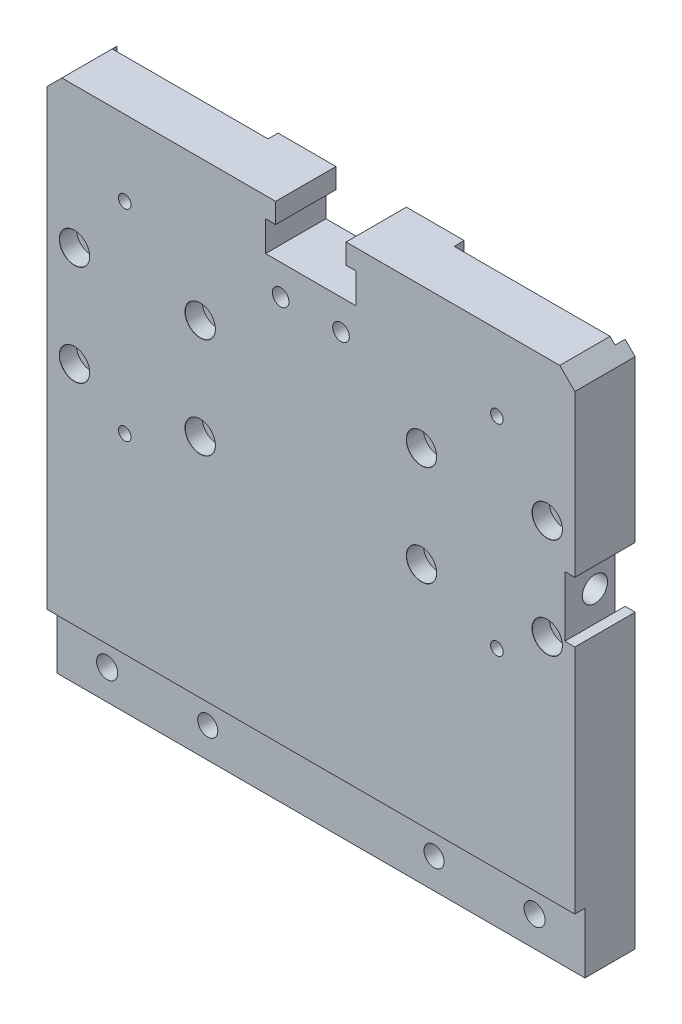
ISO-10303-21;
HEADER;
FILE_DESCRIPTION(('STEP AP214'),'2;1');
FILE_NAME('part.step','',(''),(''),'','','');
FILE_SCHEMA(('AUTOMOTIVE_DESIGN { 1 0 10303 214 1 1 1 1 }'));
ENDSEC;
DATA;
#1=APPLICATION_CONTEXT('core data for automotive mechanical design processes');
#2=APPLICATION_PROTOCOL_DEFINITION('international standard','automotive_design',2000,#1);
#3=PRODUCT_CONTEXT('',#1,'mechanical');
#4=PRODUCT('Part','Part','',(#3));
#5=PRODUCT_RELATED_PRODUCT_CATEGORY('part','',(#4));
#6=PRODUCT_DEFINITION_FORMATION('','',#4);
#7=PRODUCT_DEFINITION_CONTEXT('part definition',#1,'design');
#8=PRODUCT_DEFINITION('design','',#6,#7);
#9=PRODUCT_DEFINITION_SHAPE('','',#8);
#10=(LENGTH_UNIT() NAMED_UNIT(*) SI_UNIT(.MILLI.,.METRE.));
#11=(NAMED_UNIT(*) PLANE_ANGLE_UNIT() SI_UNIT($,.RADIAN.));
#12=(NAMED_UNIT(*) SI_UNIT($,.STERADIAN.) SOLID_ANGLE_UNIT());
#13=UNCERTAINTY_MEASURE_WITH_UNIT(LENGTH_MEASURE(1.E-05),#10,'distance_accuracy_value','');
#14=(GEOMETRIC_REPRESENTATION_CONTEXT(3) GLOBAL_UNCERTAINTY_ASSIGNED_CONTEXT((#13)) GLOBAL_UNIT_ASSIGNED_CONTEXT((#10,
#11,#12)) REPRESENTATION_CONTEXT('',''));
#15=CARTESIAN_POINT('',(0.,0.,0.));
#16=DIRECTION('',(0.,0.,1.));
#17=DIRECTION('',(1.,0.,0.));
#18=AXIS2_PLACEMENT_3D('',#15,#16,#17);
#19=CARTESIAN_POINT('',(0.,0.,0.));
#20=DIRECTION('',(0.,0.,-1.));
#21=DIRECTION('',(-1.,0.,0.));
#22=AXIS2_PLACEMENT_3D('',#19,#20,#21);
#23=PLANE('',#22);
#24=DIRECTION('',(1.,0.,0.));
#25=VECTOR('',#24,1.);
#26=CARTESIAN_POINT('',(89.5,11.1125258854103,0.));
#27=LINE('',#26,#25);
#28=CARTESIAN_POINT('',(87.5,11.1125258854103,0.));
#29=VERTEX_POINT('',#28);
#30=CARTESIAN_POINT('',(89.5,11.1125258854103,0.));
#31=VERTEX_POINT('',#30);
#32=EDGE_CURVE('E229',#29,#31,#27,.T.);
#33=ORIENTED_EDGE('',*,*,#32,.T.);
#34=DIRECTION('',(0.,1.,0.));
#35=VECTOR('',#34,1.);
#36=CARTESIAN_POINT('',(89.5,-46.8874741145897,0.));
#37=LINE('',#36,#35);
#38=CARTESIAN_POINT('',(89.5,-46.8874741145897,0.));
#39=VERTEX_POINT('',#38);
#40=EDGE_CURVE('E616',#39,#31,#37,.T.);
#41=ORIENTED_EDGE('',*,*,#40,.F.);
#42=DIRECTION('',(1.,0.,0.));
#43=VECTOR('',#42,1.);
#44=CARTESIAN_POINT('',(-15.5,-46.8874741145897,0.));
#45=LINE('',#44,#43);
#46=CARTESIAN_POINT('',(87.5,-46.8874741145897,0.));
#47=VERTEX_POINT('',#46);
#48=EDGE_CURVE('E622',#47,#39,#45,.T.);
#49=ORIENTED_EDGE('',*,*,#48,.F.);
#50=DIRECTION('',(0.,1.,0.));
#51=VECTOR('',#50,1.);
#52=CARTESIAN_POINT('',(87.5,-46.8874741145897,0.));
#53=LINE('',#52,#51);
#54=EDGE_CURVE('E515',#47,#29,#53,.T.);
#55=ORIENTED_EDGE('',*,*,#54,.T.);
#56=EDGE_LOOP('',(#33,#41,#49,#55));
#57=FACE_BOUND('',#56,.T.);
#58=ADVANCED_FACE('F16',(#57),#23,.T.);
#59=CARTESIAN_POINT('',(89.5,-46.8874741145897,12.));
#60=DIRECTION('',(-1.,0.,0.));
#61=DIRECTION('',(0.,0.,1.));
#62=AXIS2_PLACEMENT_3D('',#59,#60,#61);
#63=PLANE('',#62);
#64=ORIENTED_EDGE('',*,*,#40,.T.);
#65=DIRECTION('',(0.,0.,1.));
#66=VECTOR('',#65,1.);
#67=CARTESIAN_POINT('',(89.5,11.1125258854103,0.));
#68=LINE('',#67,#66);
#69=CARTESIAN_POINT('',(89.5,11.1125258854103,12.));
#70=VERTEX_POINT('',#69);
#71=EDGE_CURVE('E237',#31,#70,#68,.T.);
#72=ORIENTED_EDGE('',*,*,#71,.T.);
#73=DIRECTION('',(0.,1.,0.));
#74=VECTOR('',#73,1.);
#75=CARTESIAN_POINT('',(89.5,-46.8874741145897,12.));
#76=LINE('',#75,#74);
#77=CARTESIAN_POINT('',(89.5,-34.8874741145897,12.));
#78=VERTEX_POINT('',#77);
#79=EDGE_CURVE('E617',#78,#70,#76,.T.);
#80=ORIENTED_EDGE('',*,*,#79,.F.);
#81=DIRECTION('',(0.,0.,1.));
#82=VECTOR('',#81,1.);
#83=CARTESIAN_POINT('',(89.5,-34.8874741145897,12.));
#84=LINE('',#83,#82);
#85=CARTESIAN_POINT('',(89.5,-34.8874741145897,10.));
#86=VERTEX_POINT('',#85);
#87=EDGE_CURVE('E599',#86,#78,#84,.T.);
#88=ORIENTED_EDGE('',*,*,#87,.F.);
#89=DIRECTION('',(0.,1.,0.));
#90=VECTOR('',#89,1.);
#91=CARTESIAN_POINT('',(89.5,-46.8874741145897,10.));
#92=LINE('',#91,#90);
#93=CARTESIAN_POINT('',(89.5,-46.8874741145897,10.));
#94=VERTEX_POINT('',#93);
#95=EDGE_CURVE('E594',#94,#86,#92,.T.);
#96=ORIENTED_EDGE('',*,*,#95,.F.);
#97=DIRECTION('',(0.,0.,-1.));
#98=VECTOR('',#97,1.);
#99=CARTESIAN_POINT('',(89.5,-46.8874741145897,12.));
#100=LINE('',#99,#98);
#101=EDGE_CURVE('E620',#94,#39,#100,.T.);
#102=ORIENTED_EDGE('',*,*,#101,.T.);
#103=EDGE_LOOP('',(#64,#72,#80,#88,#96,#102));
#104=FACE_BOUND('',#103,.T.);
#105=ADVANCED_FACE('F761',(#104),#63,.F.);
#106=CARTESIAN_POINT('',(87.5,-46.8874741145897,0.));
#107=DIRECTION('',(1.,0.,0.));
#108=DIRECTION('',(0.,0.,-1.));
#109=AXIS2_PLACEMENT_3D('',#106,#107,#108);
#110=PLANE('',#109);
#111=DIRECTION('',(0.,1.,0.));
#112=VECTOR('',#111,1.);
#113=CARTESIAN_POINT('',(87.5,-46.8874741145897,2.));
#114=LINE('',#113,#112);
#115=CARTESIAN_POINT('',(87.5,-46.8874741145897,2.));
#116=VERTEX_POINT('',#115);
#117=CARTESIAN_POINT('',(87.5,11.1125258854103,2.));
#118=VERTEX_POINT('',#117);
#119=EDGE_CURVE('E519',#116,#118,#114,.T.);
#120=ORIENTED_EDGE('',*,*,#119,.T.);
#121=DIRECTION('',(0.,0.,1.));
#122=VECTOR('',#121,1.);
#123=CARTESIAN_POINT('',(87.5,11.1125258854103,0.));
#124=LINE('',#123,#122);
#125=EDGE_CURVE('E241',#29,#118,#124,.T.);
#126=ORIENTED_EDGE('',*,*,#125,.F.);
#127=ORIENTED_EDGE('',*,*,#54,.F.);
#128=DIRECTION('',(0.,0.,-1.));
#129=VECTOR('',#128,1.);
#130=CARTESIAN_POINT('',(87.5,-46.8874741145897,0.));
#131=LINE('',#130,#129);
#132=EDGE_CURVE('E507',#116,#47,#131,.T.);
#133=ORIENTED_EDGE('',*,*,#132,.F.);
#134=EDGE_LOOP('',(#120,#126,#127,#133));
#135=FACE_BOUND('',#134,.T.);
#136=ADVANCED_FACE('F771',(#135),#110,.F.);
#137=CARTESIAN_POINT('',(0.,0.,12.));
#138=DIRECTION('',(0.,0.,-1.));
#139=DIRECTION('',(-1.,0.,0.));
#140=AXIS2_PLACEMENT_3D('',#137,#138,#139);
#141=PLANE('',#140);
#142=CARTESIAN_POINT('',(-10.,30.1125258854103,12.));
#143=DIRECTION('',(0.,0.,1.));
#144=DIRECTION('',(1.,0.,0.));
#145=AXIS2_PLACEMENT_3D('',#142,#143,#144);
#146=CIRCLE('',#145,3.025);
#147=CARTESIAN_POINT('',(-6.975,30.1125258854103,12.));
#148=VERTEX_POINT('',#147);
#149=EDGE_CURVE('E335',#148,#148,#146,.T.);
#150=ORIENTED_EDGE('',*,*,#149,.F.);
#151=EDGE_LOOP('',(#150));
#152=FACE_BOUND('',#151,.T.);
#153=CARTESIAN_POINT('',(-10.,10.1125258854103,12.));
#154=DIRECTION('',(0.,0.,1.));
#155=DIRECTION('',(1.,0.,0.));
#156=AXIS2_PLACEMENT_3D('',#153,#154,#155);
#157=CIRCLE('',#156,3.025);
#158=CARTESIAN_POINT('',(-6.975,10.1125258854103,12.));
#159=VERTEX_POINT('',#158);
#160=EDGE_CURVE('E356',#159,#159,#157,.T.);
#161=ORIENTED_EDGE('',*,*,#160,.F.);
#162=EDGE_LOOP('',(#161));
#163=FACE_BOUND('',#162,.T.);
#164=CARTESIAN_POINT('',(15.,10.1125258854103,12.));
#165=DIRECTION('',(0.,0.,1.));
#166=DIRECTION('',(1.,0.,0.));
#167=AXIS2_PLACEMENT_3D('',#164,#165,#166);
#168=CIRCLE('',#167,3.025);
#169=CARTESIAN_POINT('',(18.025,10.1125258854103,12.));
#170=VERTEX_POINT('',#169);
#171=EDGE_CURVE('E377',#170,#170,#168,.T.);
#172=ORIENTED_EDGE('',*,*,#171,.F.);
#173=EDGE_LOOP('',(#172));
#174=FACE_BOUND('',#173,.T.);
#175=CARTESIAN_POINT('',(0.,3.11252588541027,12.));
#176=DIRECTION('',(0.,0.,1.));
#177=DIRECTION('',(1.,0.,0.));
#178=AXIS2_PLACEMENT_3D('',#175,#176,#177);
#179=CIRCLE('',#178,1.25);
#180=CARTESIAN_POINT('',(1.24999999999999,3.11252588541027,12.));
#181=VERTEX_POINT('',#180);
#182=EDGE_CURVE('E416',#181,#181,#179,.T.);
#183=ORIENTED_EDGE('',*,*,#182,.F.);
#184=EDGE_LOOP('',(#183));
#185=FACE_BOUND('',#184,.T.);
#186=CARTESIAN_POINT('',(0.,43.1125258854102,12.));
#187=DIRECTION('',(0.,0.,1.));
#188=DIRECTION('',(1.,0.,0.));
#189=AXIS2_PLACEMENT_3D('',#186,#187,#188);
#190=CIRCLE('',#189,1.25);
#191=CARTESIAN_POINT('',(1.24999999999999,43.1125258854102,12.));
#192=VERTEX_POINT('',#191);
#193=EDGE_CURVE('E422',#192,#192,#190,.T.);
#194=ORIENTED_EDGE('',*,*,#193,.F.);
#195=EDGE_LOOP('',(#194));
#196=FACE_BOUND('',#195,.T.);
#197=CARTESIAN_POINT('',(74.,3.11252588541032,12.));
#198=DIRECTION('',(0.,0.,1.));
#199=DIRECTION('',(1.,0.,0.));
#200=AXIS2_PLACEMENT_3D('',#197,#198,#199);
#201=CIRCLE('',#200,1.25);
#202=CARTESIAN_POINT('',(75.25,3.11252588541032,12.));
#203=VERTEX_POINT('',#202);
#204=EDGE_CURVE('E428',#203,#203,#201,.T.);
#205=ORIENTED_EDGE('',*,*,#204,.F.);
#206=EDGE_LOOP('',(#205));
#207=FACE_BOUND('',#206,.T.);
#208=CARTESIAN_POINT('',(74.,43.1125258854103,12.));
#209=DIRECTION('',(0.,0.,1.));
#210=DIRECTION('',(1.,0.,0.));
#211=AXIS2_PLACEMENT_3D('',#208,#209,#210);
#212=CIRCLE('',#211,1.25);
#213=CARTESIAN_POINT('',(75.25,43.1125258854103,12.));
#214=VERTEX_POINT('',#213);
#215=EDGE_CURVE('E434',#214,#214,#212,.T.);
#216=ORIENTED_EDGE('',*,*,#215,.F.);
#217=EDGE_LOOP('',(#216));
#218=FACE_BOUND('',#217,.T.);
#219=CARTESIAN_POINT('',(31.,42.1125258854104,12.));
#220=DIRECTION('',(0.,0.,1.));
#221=DIRECTION('',(1.,0.,0.));
#222=AXIS2_PLACEMENT_3D('',#219,#220,#221);
#223=CIRCLE('',#222,1.65);
#224=CARTESIAN_POINT('',(32.65,42.1125258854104,12.));
#225=VERTEX_POINT('',#224);
#226=EDGE_CURVE('E582',#225,#225,#223,.T.);
#227=ORIENTED_EDGE('',*,*,#226,.F.);
#228=EDGE_LOOP('',(#227));
#229=FACE_BOUND('',#228,.T.);
#230=CARTESIAN_POINT('',(43.,42.1125258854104,12.));
#231=DIRECTION('',(0.,0.,1.));
#232=DIRECTION('',(1.,0.,0.));
#233=AXIS2_PLACEMENT_3D('',#230,#231,#232);
#234=CIRCLE('',#233,1.65);
#235=CARTESIAN_POINT('',(44.65,42.1125258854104,12.));
#236=VERTEX_POINT('',#235);
#237=EDGE_CURVE('E588',#236,#236,#234,.T.);
#238=ORIENTED_EDGE('',*,*,#237,.F.);
#239=EDGE_LOOP('',(#238));
#240=FACE_BOUND('',#239,.T.);
#241=ORIENTED_EDGE('',*,*,#79,.T.);
#242=DIRECTION('',(1.,0.,0.));
#243=VECTOR('',#242,1.);
#244=CARTESIAN_POINT('',(89.5,11.1125258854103,12.));
#245=LINE('',#244,#243);
#246=CARTESIAN_POINT('',(87.5,11.1125258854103,12.));
#247=VERTEX_POINT('',#246);
#248=EDGE_CURVE('E230',#247,#70,#245,.T.);
#249=ORIENTED_EDGE('',*,*,#248,.F.);
#250=DIRECTION('',(0.,-1.,0.));
#251=VECTOR('',#250,1.);
#252=CARTESIAN_POINT('',(87.5,11.1125258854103,12.));
#253=LINE('',#252,#251);
#254=CARTESIAN_POINT('',(87.5,23.1125258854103,12.));
#255=VERTEX_POINT('',#254);
#256=EDGE_CURVE('E222',#255,#247,#253,.T.);
#257=ORIENTED_EDGE('',*,*,#256,.F.);
#258=DIRECTION('',(-1.,0.,0.));
#259=VECTOR('',#258,1.);
#260=CARTESIAN_POINT('',(89.5,23.1125258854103,12.));
#261=LINE('',#260,#259);
#262=CARTESIAN_POINT('',(89.5,23.1125258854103,12.));
#263=VERTEX_POINT('',#262);
#264=EDGE_CURVE('E219',#263,#255,#261,.T.);
#265=ORIENTED_EDGE('',*,*,#264,.F.);
#266=CARTESIAN_POINT('',(89.5,55.1125258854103,12.));
#267=VERTEX_POINT('',#266);
#268=EDGE_CURVE('E615',#263,#267,#76,.T.);
#269=ORIENTED_EDGE('',*,*,#268,.T.);
#270=DIRECTION('',(0.707106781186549,-0.707106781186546,0.));
#271=VECTOR('',#270,1.);
#272=CARTESIAN_POINT('',(89.5,55.1125258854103,12.));
#273=LINE('',#272,#271);
#274=CARTESIAN_POINT('',(86.5,58.1125258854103,12.));
#275=VERTEX_POINT('',#274);
#276=EDGE_CURVE('E638',#267,#275,#273,.F.);
#277=ORIENTED_EDGE('',*,*,#276,.T.);
#278=DIRECTION('',(1.,0.,0.));
#279=VECTOR('',#278,1.);
#280=CARTESIAN_POINT('',(-15.5,58.1125258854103,12.));
#281=LINE('',#280,#279);
#282=CARTESIAN_POINT('',(44.,58.1125258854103,12.));
#283=VERTEX_POINT('',#282);
#284=EDGE_CURVE('E564',#283,#275,#281,.T.);
#285=ORIENTED_EDGE('',*,*,#284,.F.);
#286=DIRECTION('',(0.,1.,0.));
#287=VECTOR('',#286,1.);
#288=CARTESIAN_POINT('',(44.,58.1125258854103,12.));
#289=LINE('',#288,#287);
#290=CARTESIAN_POINT('',(44.,54.1125258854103,12.));
#291=VERTEX_POINT('',#290);
#292=EDGE_CURVE('E445',#291,#283,#289,.T.);
#293=ORIENTED_EDGE('',*,*,#292,.F.);
#294=DIRECTION('',(-1.,0.,0.));
#295=VECTOR('',#294,1.);
#296=CARTESIAN_POINT('',(44.,54.1125258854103,12.));
#297=LINE('',#296,#295);
#298=CARTESIAN_POINT('',(46.,54.1125258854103,12.));
#299=VERTEX_POINT('',#298);
#300=EDGE_CURVE('E478',#299,#291,#297,.T.);
#301=ORIENTED_EDGE('',*,*,#300,.F.);
#302=DIRECTION('',(0.,1.,0.));
#303=VECTOR('',#302,1.);
#304=CARTESIAN_POINT('',(46.,54.1125258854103,12.));
#305=LINE('',#304,#303);
#306=CARTESIAN_POINT('',(46.,48.1125258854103,12.));
#307=VERTEX_POINT('',#306);
#308=EDGE_CURVE('E475',#307,#299,#305,.T.);
#309=ORIENTED_EDGE('',*,*,#308,.F.);
#310=DIRECTION('',(1.,0.,0.));
#311=VECTOR('',#310,1.);
#312=CARTESIAN_POINT('',(28.,48.1125258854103,12.));
#313=LINE('',#312,#311);
#314=CARTESIAN_POINT('',(28.,48.1125258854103,12.));
#315=VERTEX_POINT('',#314);
#316=EDGE_CURVE('E472',#315,#307,#313,.T.);
#317=ORIENTED_EDGE('',*,*,#316,.F.);
#318=DIRECTION('',(0.,-1.,0.));
#319=VECTOR('',#318,1.);
#320=CARTESIAN_POINT('',(28.,54.1125258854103,12.));
#321=LINE('',#320,#319);
#322=CARTESIAN_POINT('',(28.,54.1125258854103,12.));
#323=VERTEX_POINT('',#322);
#324=EDGE_CURVE('E469',#323,#315,#321,.T.);
#325=ORIENTED_EDGE('',*,*,#324,.F.);
#326=DIRECTION('',(-1.,0.,0.));
#327=VECTOR('',#326,1.);
#328=CARTESIAN_POINT('',(30.,54.1125258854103,12.));
#329=LINE('',#328,#327);
#330=CARTESIAN_POINT('',(30.,54.1125258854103,12.));
#331=VERTEX_POINT('',#330);
#332=EDGE_CURVE('E466',#331,#323,#329,.T.);
#333=ORIENTED_EDGE('',*,*,#332,.F.);
#334=DIRECTION('',(0.,-1.,0.));
#335=VECTOR('',#334,1.);
#336=CARTESIAN_POINT('',(30.,58.1125258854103,12.));
#337=LINE('',#336,#335);
#338=CARTESIAN_POINT('',(30.,58.1125258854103,12.));
#339=VERTEX_POINT('',#338);
#340=EDGE_CURVE('E440',#339,#331,#337,.T.);
#341=ORIENTED_EDGE('',*,*,#340,.F.);
#342=CARTESIAN_POINT('',(-12.5,58.1125258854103,12.));
#343=VERTEX_POINT('',#342);
#344=EDGE_CURVE('E568',#343,#339,#281,.T.);
#345=ORIENTED_EDGE('',*,*,#344,.F.);
#346=DIRECTION('',(0.707106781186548,0.707106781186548,0.));
#347=VECTOR('',#346,1.);
#348=CARTESIAN_POINT('',(-12.5,58.1125258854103,12.));
#349=LINE('',#348,#347);
#350=CARTESIAN_POINT('',(-15.5,55.1125258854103,12.));
#351=VERTEX_POINT('',#350);
#352=EDGE_CURVE('E640',#343,#351,#349,.F.);
#353=ORIENTED_EDGE('',*,*,#352,.T.);
#354=DIRECTION('',(0.,-1.,0.));
#355=VECTOR('',#354,1.);
#356=CARTESIAN_POINT('',(-15.5,-46.8874741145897,12.));
#357=LINE('',#356,#355);
#358=CARTESIAN_POINT('',(-15.5,-34.8874741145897,12.));
#359=VERTEX_POINT('',#358);
#360=EDGE_CURVE('E613',#351,#359,#357,.T.);
#361=ORIENTED_EDGE('',*,*,#360,.T.);
#362=DIRECTION('',(1.,0.,0.));
#363=VECTOR('',#362,1.);
#364=CARTESIAN_POINT('',(-15.5,-34.8874741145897,12.));
#365=LINE('',#364,#363);
#366=EDGE_CURVE('E606',#359,#78,#365,.T.);
#367=ORIENTED_EDGE('',*,*,#366,.T.);
#368=EDGE_LOOP('',(#241,#249,#257,#265,#269,#277,#285,#293,#301,#309,#317,#325,#333,#341,#345,
#353,#361,#367));
#369=FACE_BOUND('',#368,.T.);
#370=CARTESIAN_POINT('',(15.,30.1125258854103,12.));
#371=DIRECTION('',(0.,0.,1.));
#372=DIRECTION('',(1.,0.,0.));
#373=AXIS2_PLACEMENT_3D('',#370,#371,#372);
#374=CIRCLE('',#373,3.025);
#375=CARTESIAN_POINT('',(18.025,30.1125258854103,12.));
#376=VERTEX_POINT('',#375);
#377=EDGE_CURVE('E398',#376,#376,#374,.T.);
#378=ORIENTED_EDGE('',*,*,#377,.F.);
#379=EDGE_LOOP('',(#378));
#380=FACE_BOUND('',#379,.T.);
#381=CARTESIAN_POINT('',(84.,30.1125258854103,12.));
#382=DIRECTION('',(0.,0.,1.));
#383=DIRECTION('',(1.,0.,0.));
#384=AXIS2_PLACEMENT_3D('',#381,#382,#383);
#385=CIRCLE('',#384,3.025);
#386=CARTESIAN_POINT('',(87.025,30.1125258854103,12.));
#387=VERTEX_POINT('',#386);
#388=EDGE_CURVE('E314',#387,#387,#385,.T.);
#389=ORIENTED_EDGE('',*,*,#388,.F.);
#390=EDGE_LOOP('',(#389));
#391=FACE_BOUND('',#390,.T.);
#392=CARTESIAN_POINT('',(84.,10.1125258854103,12.));
#393=DIRECTION('',(0.,0.,1.));
#394=DIRECTION('',(1.,0.,0.));
#395=AXIS2_PLACEMENT_3D('',#392,#393,#394);
#396=CIRCLE('',#395,3.025);
#397=CARTESIAN_POINT('',(87.025,10.1125258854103,12.));
#398=VERTEX_POINT('',#397);
#399=EDGE_CURVE('E293',#398,#398,#396,.T.);
#400=ORIENTED_EDGE('',*,*,#399,.F.);
#401=EDGE_LOOP('',(#400));
#402=FACE_BOUND('',#401,.T.);
#403=CARTESIAN_POINT('',(59.,10.1125258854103,12.));
#404=DIRECTION('',(0.,0.,1.));
#405=DIRECTION('',(1.,0.,0.));
#406=AXIS2_PLACEMENT_3D('',#403,#404,#405);
#407=CIRCLE('',#406,3.025);
#408=CARTESIAN_POINT('',(62.025,10.1125258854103,12.));
#409=VERTEX_POINT('',#408);
#410=EDGE_CURVE('E272',#409,#409,#407,.T.);
#411=ORIENTED_EDGE('',*,*,#410,.F.);
#412=EDGE_LOOP('',(#411));
#413=FACE_BOUND('',#412,.T.);
#414=CARTESIAN_POINT('',(59.,30.1125258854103,12.));
#415=DIRECTION('',(0.,0.,1.));
#416=DIRECTION('',(1.,0.,0.));
#417=AXIS2_PLACEMENT_3D('',#414,#415,#416);
#418=CIRCLE('',#417,3.025);
#419=CARTESIAN_POINT('',(62.025,30.1125258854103,12.));
#420=VERTEX_POINT('',#419);
#421=EDGE_CURVE('E251',#420,#420,#418,.T.);
#422=ORIENTED_EDGE('',*,*,#421,.F.);
#423=EDGE_LOOP('',(#422));
#424=FACE_BOUND('',#423,.T.);
#425=ADVANCED_FACE('F675',(#152,#163,#174,#185,#196,#207,#218,#229,#240,#369,#380,#391,#402,
#413,#424),#141,.F.);
#426=CARTESIAN_POINT('',(-15.5,58.1125258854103,0.));
#427=DIRECTION('',(0.,-1.,0.));
#428=DIRECTION('',(0.,0.,-1.));
#429=AXIS2_PLACEMENT_3D('',#426,#427,#428);
#430=PLANE('',#429);
#431=ORIENTED_EDGE('',*,*,#284,.T.);
#432=DIRECTION('',(0.,0.,-1.));
#433=VECTOR('',#432,1.);
#434=CARTESIAN_POINT('',(86.5,58.1125258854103,0.));
#435=LINE('',#434,#433);
#436=CARTESIAN_POINT('',(86.5,58.1125258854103,2.));
#437=VERTEX_POINT('',#436);
#438=EDGE_CURVE('E653',#275,#437,#435,.T.);
#439=ORIENTED_EDGE('',*,*,#438,.T.);
#440=DIRECTION('',(1.,0.,0.));
#441=VECTOR('',#440,1.);
#442=CARTESIAN_POINT('',(87.5,58.1125258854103,2.));
#443=LINE('',#442,#441);
#444=CARTESIAN_POINT('',(55.5,58.1125258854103,2.));
#445=VERTEX_POINT('',#444);
#446=EDGE_CURVE('E504',#445,#437,#443,.T.);
#447=ORIENTED_EDGE('',*,*,#446,.F.);
#448=DIRECTION('',(0.,0.,1.));
#449=VECTOR('',#448,1.);
#450=CARTESIAN_POINT('',(55.5,58.1125258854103,0.));
#451=LINE('',#450,#449);
#452=CARTESIAN_POINT('',(55.5,58.1125258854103,0.));
#453=VERTEX_POINT('',#452);
#454=EDGE_CURVE('E485',#453,#445,#451,.T.);
#455=ORIENTED_EDGE('',*,*,#454,.F.);
#456=DIRECTION('',(1.,0.,0.));
#457=VECTOR('',#456,1.);
#458=CARTESIAN_POINT('',(-15.5,58.1125258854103,0.));
#459=LINE('',#458,#457);
#460=CARTESIAN_POINT('',(44.,58.1125258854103,0.));
#461=VERTEX_POINT('',#460);
#462=EDGE_CURVE('E565',#461,#453,#459,.T.);
#463=ORIENTED_EDGE('',*,*,#462,.F.);
#464=DIRECTION('',(0.,0.,1.));
#465=VECTOR('',#464,1.);
#466=CARTESIAN_POINT('',(44.,58.1125258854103,0.));
#467=LINE('',#466,#465);
#468=EDGE_CURVE('E482',#461,#283,#467,.T.);
#469=ORIENTED_EDGE('',*,*,#468,.T.);
#470=EDGE_LOOP('',(#431,#439,#447,#455,#463,#469));
#471=FACE_BOUND('',#470,.T.);
#472=ADVANCED_FACE('F688',(#471),#430,.F.);
#473=DIRECTION('',(-1.,0.,0.));
#474=VECTOR('',#473,1.);
#475=CARTESIAN_POINT('',(89.5,23.1125258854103,0.));
#476=LINE('',#475,#474);
#477=CARTESIAN_POINT('',(89.5,23.1125258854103,0.));
#478=VERTEX_POINT('',#477);
#479=CARTESIAN_POINT('',(87.5,23.1125258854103,0.));
#480=VERTEX_POINT('',#479);
#481=EDGE_CURVE('E227',#478,#480,#476,.T.);
#482=ORIENTED_EDGE('',*,*,#481,.T.);
#483=CARTESIAN_POINT('',(87.5,57.1125258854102,0.));
#484=VERTEX_POINT('',#483);
#485=EDGE_CURVE('E38',#480,#484,#53,.T.);
#486=ORIENTED_EDGE('',*,*,#485,.T.);
#487=DIRECTION('',(-0.707106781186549,0.707106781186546,0.));
#488=VECTOR('',#487,1.);
#489=CARTESIAN_POINT('',(72.3062629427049,72.3062629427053,0.));
#490=LINE('',#489,#488);
#491=CARTESIAN_POINT('',(89.5,55.1125258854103,0.));
#492=VERTEX_POINT('',#491);
#493=EDGE_CURVE('E11',#484,#492,#490,.F.);
#494=ORIENTED_EDGE('',*,*,#493,.T.);
#495=EDGE_CURVE('E626',#478,#492,#37,.T.);
#496=ORIENTED_EDGE('',*,*,#495,.F.);
#497=EDGE_LOOP('',(#482,#486,#494,#496));
#498=FACE_BOUND('',#497,.T.);
#499=ADVANCED_FACE('F667',(#498),#23,.T.);
#500=DIRECTION('',(0.,-1.,0.));
#501=VECTOR('',#500,1.);
#502=CARTESIAN_POINT('',(-15.5,-46.8874741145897,0.));
#503=LINE('',#502,#501);
#504=CARTESIAN_POINT('',(-15.5,55.1125258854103,0.));
#505=VERTEX_POINT('',#504);
#506=CARTESIAN_POINT('',(-15.5,-46.8874741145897,0.));
#507=VERTEX_POINT('',#506);
#508=EDGE_CURVE('E609',#505,#507,#503,.T.);
#509=ORIENTED_EDGE('',*,*,#508,.F.);
#510=DIRECTION('',(-0.707106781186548,-0.707106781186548,0.));
#511=VECTOR('',#510,1.);
#512=CARTESIAN_POINT('',(-35.3062629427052,35.3062629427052,0.));
#513=LINE('',#512,#511);
#514=CARTESIAN_POINT('',(-13.5,57.1125258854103,0.));
#515=VERTEX_POINT('',#514);
#516=EDGE_CURVE('E644',#505,#515,#513,.F.);
#517=ORIENTED_EDGE('',*,*,#516,.T.);
#518=DIRECTION('',(0.,1.,0.));
#519=VECTOR('',#518,1.);
#520=CARTESIAN_POINT('',(-13.5,-46.8874741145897,0.));
#521=LINE('',#520,#519);
#522=CARTESIAN_POINT('',(-13.5,-46.8874741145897,0.));
#523=VERTEX_POINT('',#522);
#524=EDGE_CURVE('E547',#523,#515,#521,.T.);
#525=ORIENTED_EDGE('',*,*,#524,.F.);
#526=EDGE_CURVE('E623',#507,#523,#45,.T.);
#527=ORIENTED_EDGE('',*,*,#526,.F.);
#528=EDGE_LOOP('',(#509,#517,#525,#527));
#529=FACE_BOUND('',#528,.T.);
#530=ADVANCED_FACE('F797',(#529),#23,.T.);
#531=CARTESIAN_POINT('',(-15.5,-46.8874741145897,12.));
#532=DIRECTION('',(1.,0.,0.));
#533=DIRECTION('',(0.,0.,-1.));
#534=AXIS2_PLACEMENT_3D('',#531,#532,#533);
#535=PLANE('',#534);
#536=ORIENTED_EDGE('',*,*,#360,.F.);
#537=DIRECTION('',(0.,0.,-1.));
#538=VECTOR('',#537,1.);
#539=CARTESIAN_POINT('',(-15.5,55.1125258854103,12.));
#540=LINE('',#539,#538);
#541=EDGE_CURVE('E642',#351,#505,#540,.T.);
#542=ORIENTED_EDGE('',*,*,#541,.T.);
#543=ORIENTED_EDGE('',*,*,#508,.T.);
#544=DIRECTION('',(0.,0.,-1.));
#545=VECTOR('',#544,1.);
#546=CARTESIAN_POINT('',(-15.5,-46.8874741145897,12.));
#547=LINE('',#546,#545);
#548=CARTESIAN_POINT('',(-15.5,-46.8874741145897,10.));
#549=VERTEX_POINT('',#548);
#550=EDGE_CURVE('E632',#549,#507,#547,.T.);
#551=ORIENTED_EDGE('',*,*,#550,.F.);
#552=DIRECTION('',(0.,1.,0.));
#553=VECTOR('',#552,1.);
#554=CARTESIAN_POINT('',(-15.5,-46.8874741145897,10.));
#555=LINE('',#554,#553);
#556=CARTESIAN_POINT('',(-15.5,-34.8874741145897,10.));
#557=VERTEX_POINT('',#556);
#558=EDGE_CURVE('E595',#549,#557,#555,.T.);
#559=ORIENTED_EDGE('',*,*,#558,.T.);
#560=DIRECTION('',(0.,0.,1.));
#561=VECTOR('',#560,1.);
#562=CARTESIAN_POINT('',(-15.5,-34.8874741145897,12.));
#563=LINE('',#562,#561);
#564=EDGE_CURVE('E598',#557,#359,#563,.T.);
#565=ORIENTED_EDGE('',*,*,#564,.T.);
#566=EDGE_LOOP('',(#536,#542,#543,#551,#559,#565));
#567=FACE_BOUND('',#566,.T.);
#568=ADVANCED_FACE('F752',(#567),#535,.F.);
#569=CARTESIAN_POINT('',(-15.5,-46.8874741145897,12.));
#570=DIRECTION('',(0.,1.,0.));
#571=DIRECTION('',(0.,0.,1.));
#572=AXIS2_PLACEMENT_3D('',#569,#570,#571);
#573=PLANE('',#572);
#574=DIRECTION('',(1.,0.,0.));
#575=VECTOR('',#574,1.);
#576=CARTESIAN_POINT('',(87.5,-46.8874741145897,2.));
#577=LINE('',#576,#575);
#578=CARTESIAN_POINT('',(55.5,-46.8874741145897,2.));
#579=VERTEX_POINT('',#578);
#580=EDGE_CURVE('E503',#579,#116,#577,.T.);
#581=ORIENTED_EDGE('',*,*,#580,.T.);
#582=ORIENTED_EDGE('',*,*,#132,.T.);
#583=ORIENTED_EDGE('',*,*,#48,.T.);
#584=ORIENTED_EDGE('',*,*,#101,.F.);
#585=DIRECTION('',(1.,0.,0.));
#586=VECTOR('',#585,1.);
#587=CARTESIAN_POINT('',(-15.5,-46.8874741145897,10.));
#588=LINE('',#587,#586);
#589=EDGE_CURVE('E602',#549,#94,#588,.T.);
#590=ORIENTED_EDGE('',*,*,#589,.F.);
#591=ORIENTED_EDGE('',*,*,#550,.T.);
#592=ORIENTED_EDGE('',*,*,#526,.T.);
#593=DIRECTION('',(0.,0.,1.));
#594=VECTOR('',#593,1.);
#595=CARTESIAN_POINT('',(-13.5,-46.8874741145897,0.));
#596=LINE('',#595,#594);
#597=CARTESIAN_POINT('',(-13.5,-46.8874741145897,2.));
#598=VERTEX_POINT('',#597);
#599=EDGE_CURVE('E534',#523,#598,#596,.T.);
#600=ORIENTED_EDGE('',*,*,#599,.T.);
#601=DIRECTION('',(1.,0.,0.));
#602=VECTOR('',#601,1.);
#603=CARTESIAN_POINT('',(-13.5,-46.8874741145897,2.));
#604=LINE('',#603,#602);
#605=CARTESIAN_POINT('',(18.5,-46.8874741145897,2.));
#606=VERTEX_POINT('',#605);
#607=EDGE_CURVE('E537',#598,#606,#604,.T.);
#608=ORIENTED_EDGE('',*,*,#607,.T.);
#609=DIRECTION('',(0.,0.,-1.));
#610=VECTOR('',#609,1.);
#611=CARTESIAN_POINT('',(18.5,-46.8874741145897,0.));
#612=LINE('',#611,#610);
#613=CARTESIAN_POINT('',(18.5,-46.8874741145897,0.));
#614=VERTEX_POINT('',#613);
#615=EDGE_CURVE('E541',#606,#614,#612,.T.);
#616=ORIENTED_EDGE('',*,*,#615,.T.);
#617=CARTESIAN_POINT('',(55.5,-46.8874741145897,0.));
#618=VERTEX_POINT('',#617);
#619=EDGE_CURVE('E627',#614,#618,#45,.T.);
#620=ORIENTED_EDGE('',*,*,#619,.T.);
#621=DIRECTION('',(0.,0.,1.));
#622=VECTOR('',#621,1.);
#623=CARTESIAN_POINT('',(55.5,-46.8874741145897,0.));
#624=LINE('',#623,#622);
#625=EDGE_CURVE('E500',#618,#579,#624,.T.);
#626=ORIENTED_EDGE('',*,*,#625,.T.);
#627=EDGE_LOOP('',(#581,#582,#583,#584,#590,#591,#592,#600,#608,#616,#620,#626));
#628=FACE_BOUND('',#627,.T.);
#629=ADVANCED_FACE('F737',(#628),#573,.F.);
#630=ORIENTED_EDGE('',*,*,#268,.F.);
#631=DIRECTION('',(0.,0.,1.));
#632=VECTOR('',#631,1.);
#633=CARTESIAN_POINT('',(89.5,23.1125258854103,0.));
#634=LINE('',#633,#632);
#635=EDGE_CURVE('E232',#478,#263,#634,.T.);
#636=ORIENTED_EDGE('',*,*,#635,.F.);
#637=ORIENTED_EDGE('',*,*,#495,.T.);
#638=DIRECTION('',(0.,0.,1.));
#639=VECTOR('',#638,1.);
#640=CARTESIAN_POINT('',(89.5,55.1125258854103,12.));
#641=LINE('',#640,#639);
#642=EDGE_CURVE('E650',#492,#267,#641,.T.);
#643=ORIENTED_EDGE('',*,*,#642,.T.);
#644=EDGE_LOOP('',(#630,#636,#637,#643));
#645=FACE_BOUND('',#644,.T.);
#646=ADVANCED_FACE('F671',(#645),#63,.F.);
#647=DIRECTION('',(0.,1.,0.));
#648=VECTOR('',#647,1.);
#649=CARTESIAN_POINT('',(44.,58.1125258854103,0.));
#650=LINE('',#649,#648);
#651=CARTESIAN_POINT('',(44.,54.1125258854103,0.));
#652=VERTEX_POINT('',#651);
#653=EDGE_CURVE('E460',#652,#461,#650,.T.);
#654=ORIENTED_EDGE('',*,*,#653,.T.);
#655=ORIENTED_EDGE('',*,*,#462,.T.);
#656=DIRECTION('',(0.,1.,0.));
#657=VECTOR('',#656,1.);
#658=CARTESIAN_POINT('',(55.5,-46.8874741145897,0.));
#659=LINE('',#658,#657);
#660=EDGE_CURVE('E510',#618,#453,#659,.T.);
#661=ORIENTED_EDGE('',*,*,#660,.F.);
#662=ORIENTED_EDGE('',*,*,#619,.F.);
#663=DIRECTION('',(0.,1.,0.));
#664=VECTOR('',#663,1.);
#665=CARTESIAN_POINT('',(18.5,-46.8874741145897,0.));
#666=LINE('',#665,#664);
#667=CARTESIAN_POINT('',(18.5,58.1125258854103,0.));
#668=VERTEX_POINT('',#667);
#669=EDGE_CURVE('E551',#614,#668,#666,.T.);
#670=ORIENTED_EDGE('',*,*,#669,.T.);
#671=CARTESIAN_POINT('',(30.,58.1125258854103,0.));
#672=VERTEX_POINT('',#671);
#673=EDGE_CURVE('E567',#668,#672,#459,.T.);
#674=ORIENTED_EDGE('',*,*,#673,.T.);
#675=DIRECTION('',(0.,-1.,0.));
#676=VECTOR('',#675,1.);
#677=CARTESIAN_POINT('',(30.,58.1125258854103,0.));
#678=LINE('',#677,#676);
#679=CARTESIAN_POINT('',(30.,54.1125258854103,0.));
#680=VERTEX_POINT('',#679);
#681=EDGE_CURVE('E441',#672,#680,#678,.T.);
#682=ORIENTED_EDGE('',*,*,#681,.T.);
#683=DIRECTION('',(-1.,0.,0.));
#684=VECTOR('',#683,1.);
#685=CARTESIAN_POINT('',(30.,54.1125258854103,0.));
#686=LINE('',#685,#684);
#687=CARTESIAN_POINT('',(28.,54.1125258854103,0.));
#688=VERTEX_POINT('',#687);
#689=EDGE_CURVE('E444',#680,#688,#686,.T.);
#690=ORIENTED_EDGE('',*,*,#689,.T.);
#691=DIRECTION('',(0.,-1.,0.));
#692=VECTOR('',#691,1.);
#693=CARTESIAN_POINT('',(28.,54.1125258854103,0.));
#694=LINE('',#693,#692);
#695=CARTESIAN_POINT('',(28.,48.1125258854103,0.));
#696=VERTEX_POINT('',#695);
#697=EDGE_CURVE('E448',#688,#696,#694,.T.);
#698=ORIENTED_EDGE('',*,*,#697,.T.);
#699=DIRECTION('',(1.,0.,0.));
#700=VECTOR('',#699,1.);
#701=CARTESIAN_POINT('',(28.,48.1125258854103,0.));
#702=LINE('',#701,#700);
#703=CARTESIAN_POINT('',(46.,48.1125258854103,0.));
#704=VERTEX_POINT('',#703);
#705=EDGE_CURVE('E451',#696,#704,#702,.T.);
#706=ORIENTED_EDGE('',*,*,#705,.T.);
#707=DIRECTION('',(0.,1.,0.));
#708=VECTOR('',#707,1.);
#709=CARTESIAN_POINT('',(46.,54.1125258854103,0.));
#710=LINE('',#709,#708);
#711=CARTESIAN_POINT('',(46.,54.1125258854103,0.));
#712=VERTEX_POINT('',#711);
#713=EDGE_CURVE('E454',#704,#712,#710,.T.);
#714=ORIENTED_EDGE('',*,*,#713,.T.);
#715=DIRECTION('',(-1.,0.,0.));
#716=VECTOR('',#715,1.);
#717=CARTESIAN_POINT('',(44.,54.1125258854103,0.));
#718=LINE('',#717,#716);
#719=EDGE_CURVE('E457',#712,#652,#718,.T.);
#720=ORIENTED_EDGE('',*,*,#719,.T.);
#721=EDGE_LOOP('',(#654,#655,#661,#662,#670,#674,#682,#690,#698,#706,#714,#720));
#722=FACE_BOUND('',#721,.T.);
#723=CARTESIAN_POINT('',(31.,42.1125258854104,0.));
#724=DIRECTION('',(0.,0.,1.));
#725=DIRECTION('',(1.,0.,0.));
#726=AXIS2_PLACEMENT_3D('',#723,#724,#725);
#727=CIRCLE('',#726,1.65);
#728=CARTESIAN_POINT('',(32.65,42.1125258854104,0.));
#729=VERTEX_POINT('',#728);
#730=EDGE_CURVE('E585',#729,#729,#727,.T.);
#731=ORIENTED_EDGE('',*,*,#730,.T.);
#732=EDGE_LOOP('',(#731));
#733=FACE_BOUND('',#732,.T.);
#734=CARTESIAN_POINT('',(43.,42.1125258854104,0.));
#735=DIRECTION('',(0.,0.,1.));
#736=DIRECTION('',(1.,0.,0.));
#737=AXIS2_PLACEMENT_3D('',#734,#735,#736);
#738=CIRCLE('',#737,1.65);
#739=CARTESIAN_POINT('',(44.65,42.1125258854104,0.));
#740=VERTEX_POINT('',#739);
#741=EDGE_CURVE('E591',#740,#740,#738,.T.);
#742=ORIENTED_EDGE('',*,*,#741,.T.);
#743=EDGE_LOOP('',(#742));
#744=FACE_BOUND('',#743,.T.);
#745=ADVANCED_FACE('F728',(#722,#733,#744),#23,.T.);
#746=CARTESIAN_POINT('',(-15.5,-34.8874741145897,12.));
#747=DIRECTION('',(0.,1.,0.));
#748=DIRECTION('',(0.,0.,1.));
#749=AXIS2_PLACEMENT_3D('',#746,#747,#748);
#750=PLANE('',#749);
#751=ORIENTED_EDGE('',*,*,#87,.T.);
#752=ORIENTED_EDGE('',*,*,#366,.F.);
#753=ORIENTED_EDGE('',*,*,#564,.F.);
#754=DIRECTION('',(1.,0.,0.));
#755=VECTOR('',#754,1.);
#756=CARTESIAN_POINT('',(-15.5,-34.8874741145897,10.));
#757=LINE('',#756,#755);
#758=EDGE_CURVE('E610',#557,#86,#757,.T.);
#759=ORIENTED_EDGE('',*,*,#758,.T.);
#760=EDGE_LOOP('',(#751,#752,#753,#759));
#761=FACE_BOUND('',#760,.T.);
#762=ADVANCED_FACE('F757',(#761),#750,.F.);
#763=CARTESIAN_POINT('',(-15.5,-46.8874741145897,10.));
#764=DIRECTION('',(0.,0.,-1.));
#765=DIRECTION('',(-1.,0.,0.));
#766=AXIS2_PLACEMENT_3D('',#763,#764,#765);
#767=PLANE('',#766);
#768=CARTESIAN_POINT('',(14.5,-40.8874741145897,10.));
#769=DIRECTION('',(0.,0.,1.));
#770=DIRECTION('',(1.,0.,0.));
#771=AXIS2_PLACEMENT_3D('',#768,#769,#770);
#772=CIRCLE('',#771,2.);
#773=CARTESIAN_POINT('',(16.5,-40.8874741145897,10.));
#774=VERTEX_POINT('',#773);
#775=EDGE_CURVE('E570',#774,#774,#772,.T.);
#776=ORIENTED_EDGE('',*,*,#775,.F.);
#777=EDGE_LOOP('',(#776));
#778=FACE_BOUND('',#777,.T.);
#779=CARTESIAN_POINT('',(59.5,-40.8874741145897,10.));
#780=DIRECTION('',(0.,0.,1.));
#781=DIRECTION('',(1.,0.,0.));
#782=AXIS2_PLACEMENT_3D('',#779,#780,#781);
#783=CIRCLE('',#782,2.);
#784=CARTESIAN_POINT('',(61.5,-40.8874741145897,10.));
#785=VERTEX_POINT('',#784);
#786=EDGE_CURVE('E573',#785,#785,#783,.T.);
#787=ORIENTED_EDGE('',*,*,#786,.F.);
#788=EDGE_LOOP('',(#787));
#789=FACE_BOUND('',#788,.T.);
#790=CARTESIAN_POINT('',(-5.5,-40.8874741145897,10.));
#791=DIRECTION('',(0.,0.,1.));
#792=DIRECTION('',(1.,0.,0.));
#793=AXIS2_PLACEMENT_3D('',#790,#791,#792);
#794=CIRCLE('',#793,2.1);
#795=CARTESIAN_POINT('',(-3.4,-40.8874741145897,10.));
#796=VERTEX_POINT('',#795);
#797=EDGE_CURVE('E576',#796,#796,#794,.T.);
#798=ORIENTED_EDGE('',*,*,#797,.F.);
#799=EDGE_LOOP('',(#798));
#800=FACE_BOUND('',#799,.T.);
#801=CARTESIAN_POINT('',(79.5,-40.8874741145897,10.));
#802=DIRECTION('',(0.,0.,1.));
#803=DIRECTION('',(1.,0.,0.));
#804=AXIS2_PLACEMENT_3D('',#801,#802,#803);
#805=CIRCLE('',#804,2.1);
#806=CARTESIAN_POINT('',(81.6,-40.8874741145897,10.));
#807=VERTEX_POINT('',#806);
#808=EDGE_CURVE('E579',#807,#807,#805,.T.);
#809=ORIENTED_EDGE('',*,*,#808,.F.);
#810=EDGE_LOOP('',(#809));
#811=FACE_BOUND('',#810,.T.);
#812=ORIENTED_EDGE('',*,*,#95,.T.);
#813=ORIENTED_EDGE('',*,*,#758,.F.);
#814=ORIENTED_EDGE('',*,*,#558,.F.);
#815=ORIENTED_EDGE('',*,*,#589,.T.);
#816=EDGE_LOOP('',(#812,#813,#814,#815));
#817=FACE_BOUND('',#816,.T.);
#818=ADVANCED_FACE('F804',(#778,#789,#800,#811,#817),#767,.F.);
#819=CARTESIAN_POINT('',(43.,42.1125258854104,12.));
#820=DIRECTION('',(0.,0.,1.));
#821=DIRECTION('',(1.,0.,0.));
#822=AXIS2_PLACEMENT_3D('',#819,#820,#821);
#823=CYLINDRICAL_SURFACE('',#822,1.65);
#824=ORIENTED_EDGE('',*,*,#741,.F.);
#825=EDGE_LOOP('',(#824));
#826=FACE_BOUND('',#825,.T.);
#827=ORIENTED_EDGE('',*,*,#237,.T.);
#828=EDGE_LOOP('',(#827));
#829=FACE_BOUND('',#828,.T.);
#830=ADVANCED_FACE('F820',(#826,#829),#823,.F.);
#831=CARTESIAN_POINT('',(31.,42.1125258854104,12.));
#832=DIRECTION('',(0.,0.,1.));
#833=DIRECTION('',(1.,0.,0.));
#834=AXIS2_PLACEMENT_3D('',#831,#832,#833);
#835=CYLINDRICAL_SURFACE('',#834,1.65);
#836=ORIENTED_EDGE('',*,*,#730,.F.);
#837=EDGE_LOOP('',(#836));
#838=FACE_BOUND('',#837,.T.);
#839=ORIENTED_EDGE('',*,*,#226,.T.);
#840=EDGE_LOOP('',(#839));
#841=FACE_BOUND('',#840,.T.);
#842=ADVANCED_FACE('F828',(#838,#841),#835,.F.);
#843=CARTESIAN_POINT('',(79.5,-40.8874741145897,10.));
#844=DIRECTION('',(0.,0.,1.));
#845=DIRECTION('',(1.,0.,0.));
#846=AXIS2_PLACEMENT_3D('',#843,#844,#845);
#847=CYLINDRICAL_SURFACE('',#846,2.1);
#848=CARTESIAN_POINT('',(79.5,-40.8874741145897,2.));
#849=DIRECTION('',(0.,0.,1.));
#850=DIRECTION('',(1.,0.,0.));
#851=AXIS2_PLACEMENT_3D('',#848,#849,#850);
#852=CIRCLE('',#851,2.1);
#853=CARTESIAN_POINT('',(81.6,-40.8874741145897,2.));
#854=VERTEX_POINT('',#853);
#855=EDGE_CURVE('E530',#854,#854,#852,.F.);
#856=ORIENTED_EDGE('',*,*,#855,.T.);
#857=EDGE_LOOP('',(#856));
#858=FACE_BOUND('',#857,.T.);
#859=ORIENTED_EDGE('',*,*,#808,.T.);
#860=EDGE_LOOP('',(#859));
#861=FACE_BOUND('',#860,.T.);
#862=ADVANCED_FACE('F861',(#858,#861),#847,.F.);
#863=CARTESIAN_POINT('',(-5.5,-40.8874741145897,10.));
#864=DIRECTION('',(0.,0.,1.));
#865=DIRECTION('',(1.,0.,0.));
#866=AXIS2_PLACEMENT_3D('',#863,#864,#865);
#867=CYLINDRICAL_SURFACE('',#866,2.1);
#868=CARTESIAN_POINT('',(-5.5,-40.8874741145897,2.));
#869=DIRECTION('',(0.,0.,1.));
#870=DIRECTION('',(1.,0.,0.));
#871=AXIS2_PLACEMENT_3D('',#868,#869,#870);
#872=CIRCLE('',#871,2.1);
#873=CARTESIAN_POINT('',(-3.4,-40.8874741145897,2.));
#874=VERTEX_POINT('',#873);
#875=EDGE_CURVE('E561',#874,#874,#872,.F.);
#876=ORIENTED_EDGE('',*,*,#875,.T.);
#877=EDGE_LOOP('',(#876));
#878=FACE_BOUND('',#877,.T.);
#879=ORIENTED_EDGE('',*,*,#797,.T.);
#880=EDGE_LOOP('',(#879));
#881=FACE_BOUND('',#880,.T.);
#882=ADVANCED_FACE('F868',(#878,#881),#867,.F.);
#883=CARTESIAN_POINT('',(59.5,-40.8874741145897,10.));
#884=DIRECTION('',(0.,0.,1.));
#885=DIRECTION('',(1.,0.,0.));
#886=AXIS2_PLACEMENT_3D('',#883,#884,#885);
#887=CYLINDRICAL_SURFACE('',#886,2.);
#888=CARTESIAN_POINT('',(59.5,-40.8874741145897,2.));
#889=DIRECTION('',(0.,0.,1.));
#890=DIRECTION('',(1.,0.,0.));
#891=AXIS2_PLACEMENT_3D('',#888,#889,#890);
#892=CIRCLE('',#891,2.);
#893=CARTESIAN_POINT('',(61.5,-40.8874741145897,2.));
#894=VERTEX_POINT('',#893);
#895=EDGE_CURVE('E518',#894,#894,#892,.F.);
#896=ORIENTED_EDGE('',*,*,#895,.T.);
#897=EDGE_LOOP('',(#896));
#898=FACE_BOUND('',#897,.T.);
#899=ORIENTED_EDGE('',*,*,#786,.T.);
#900=EDGE_LOOP('',(#899));
#901=FACE_BOUND('',#900,.T.);
#902=ADVANCED_FACE('F875',(#898,#901),#887,.F.);
#903=CARTESIAN_POINT('',(14.5,-40.8874741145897,10.));
#904=DIRECTION('',(0.,0.,1.));
#905=DIRECTION('',(1.,0.,0.));
#906=AXIS2_PLACEMENT_3D('',#903,#904,#905);
#907=CYLINDRICAL_SURFACE('',#906,2.);
#908=CARTESIAN_POINT('',(14.5,-40.8874741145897,2.));
#909=DIRECTION('',(0.,0.,1.));
#910=DIRECTION('',(1.,0.,0.));
#911=AXIS2_PLACEMENT_3D('',#908,#909,#910);
#912=CIRCLE('',#911,2.);
#913=CARTESIAN_POINT('',(16.5,-40.8874741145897,2.));
#914=VERTEX_POINT('',#913);
#915=EDGE_CURVE('E550',#914,#914,#912,.F.);
#916=ORIENTED_EDGE('',*,*,#915,.T.);
#917=EDGE_LOOP('',(#916));
#918=FACE_BOUND('',#917,.T.);
#919=ORIENTED_EDGE('',*,*,#775,.T.);
#920=EDGE_LOOP('',(#919));
#921=FACE_BOUND('',#920,.T.);
#922=ADVANCED_FACE('F879',(#918,#921),#907,.F.);
#923=DIRECTION('',(1.,0.,0.));
#924=VECTOR('',#923,1.);
#925=CARTESIAN_POINT('',(-13.5,58.1125258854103,2.));
#926=LINE('',#925,#924);
#927=CARTESIAN_POINT('',(-12.5,58.1125258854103,2.));
#928=VERTEX_POINT('',#927);
#929=CARTESIAN_POINT('',(18.5,58.1125258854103,2.));
#930=VERTEX_POINT('',#929);
#931=EDGE_CURVE('E533',#928,#930,#926,.T.);
#932=ORIENTED_EDGE('',*,*,#931,.F.);
#933=DIRECTION('',(0.,0.,1.));
#934=VECTOR('',#933,1.);
#935=CARTESIAN_POINT('',(-12.5,58.1125258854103,0.));
#936=LINE('',#935,#934);
#937=EDGE_CURVE('E635',#928,#343,#936,.T.);
#938=ORIENTED_EDGE('',*,*,#937,.T.);
#939=ORIENTED_EDGE('',*,*,#344,.T.);
#940=DIRECTION('',(0.,0.,1.));
#941=VECTOR('',#940,1.);
#942=CARTESIAN_POINT('',(30.,58.1125258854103,0.));
#943=LINE('',#942,#941);
#944=EDGE_CURVE('E463',#672,#339,#943,.T.);
#945=ORIENTED_EDGE('',*,*,#944,.F.);
#946=ORIENTED_EDGE('',*,*,#673,.F.);
#947=DIRECTION('',(0.,0.,-1.));
#948=VECTOR('',#947,1.);
#949=CARTESIAN_POINT('',(18.5,58.1125258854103,0.));
#950=LINE('',#949,#948);
#951=EDGE_CURVE('E538',#930,#668,#950,.T.);
#952=ORIENTED_EDGE('',*,*,#951,.F.);
#953=EDGE_LOOP('',(#932,#938,#939,#945,#946,#952));
#954=FACE_BOUND('',#953,.T.);
#955=ADVANCED_FACE('F725',(#954),#430,.F.);
#956=CARTESIAN_POINT('',(-13.5,-46.8874741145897,2.));
#957=DIRECTION('',(0.,0.,1.));
#958=DIRECTION('',(1.,0.,0.));
#959=AXIS2_PLACEMENT_3D('',#956,#957,#958);
#960=PLANE('',#959);
#961=CARTESIAN_POINT('',(-10.,30.1125258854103,2.));
#962=DIRECTION('',(0.,0.,1.));
#963=DIRECTION('',(1.,0.,0.));
#964=AXIS2_PLACEMENT_3D('',#961,#962,#963);
#965=CIRCLE('',#964,1.725);
#966=CARTESIAN_POINT('',(-8.275,30.1125258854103,2.));
#967=VERTEX_POINT('',#966);
#968=EDGE_CURVE('E332',#967,#967,#965,.T.);
#969=ORIENTED_EDGE('',*,*,#968,.T.);
#970=EDGE_LOOP('',(#969));
#971=FACE_BOUND('',#970,.T.);
#972=CARTESIAN_POINT('',(-10.,10.1125258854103,2.));
#973=DIRECTION('',(0.,0.,1.));
#974=DIRECTION('',(1.,0.,0.));
#975=AXIS2_PLACEMENT_3D('',#972,#973,#974);
#976=CIRCLE('',#975,1.725);
#977=CARTESIAN_POINT('',(-8.275,10.1125258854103,2.));
#978=VERTEX_POINT('',#977);
#979=EDGE_CURVE('E353',#978,#978,#976,.T.);
#980=ORIENTED_EDGE('',*,*,#979,.T.);
#981=EDGE_LOOP('',(#980));
#982=FACE_BOUND('',#981,.T.);
#983=CARTESIAN_POINT('',(15.,10.1125258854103,2.));
#984=DIRECTION('',(0.,0.,1.));
#985=DIRECTION('',(1.,0.,0.));
#986=AXIS2_PLACEMENT_3D('',#983,#984,#985);
#987=CIRCLE('',#986,1.725);
#988=CARTESIAN_POINT('',(16.725,10.1125258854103,2.));
#989=VERTEX_POINT('',#988);
#990=EDGE_CURVE('E374',#989,#989,#987,.T.);
#991=ORIENTED_EDGE('',*,*,#990,.T.);
#992=EDGE_LOOP('',(#991));
#993=FACE_BOUND('',#992,.T.);
#994=CARTESIAN_POINT('',(15.,30.1125258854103,2.));
#995=DIRECTION('',(0.,0.,1.));
#996=DIRECTION('',(1.,0.,0.));
#997=AXIS2_PLACEMENT_3D('',#994,#995,#996);
#998=CIRCLE('',#997,1.725);
#999=CARTESIAN_POINT('',(16.725,30.1125258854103,2.));
#1000=VERTEX_POINT('',#999);
#1001=EDGE_CURVE('E395',#1000,#1000,#998,.T.);
#1002=ORIENTED_EDGE('',*,*,#1001,.T.);
#1003=EDGE_LOOP('',(#1002));
#1004=FACE_BOUND('',#1003,.T.);
#1005=CARTESIAN_POINT('',(0.,3.11252588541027,2.));
#1006=DIRECTION('',(0.,0.,1.));
#1007=DIRECTION('',(1.,0.,0.));
#1008=AXIS2_PLACEMENT_3D('',#1005,#1006,#1007);
#1009=CIRCLE('',#1008,1.25);
#1010=CARTESIAN_POINT('',(1.24999999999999,3.11252588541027,2.));
#1011=VERTEX_POINT('',#1010);
#1012=EDGE_CURVE('E419',#1011,#1011,#1009,.T.);
#1013=ORIENTED_EDGE('',*,*,#1012,.T.);
#1014=EDGE_LOOP('',(#1013));
#1015=FACE_BOUND('',#1014,.T.);
#1016=CARTESIAN_POINT('',(0.,43.1125258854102,2.));
#1017=DIRECTION('',(0.,0.,1.));
#1018=DIRECTION('',(1.,0.,0.));
#1019=AXIS2_PLACEMENT_3D('',#1016,#1017,#1018);
#1020=CIRCLE('',#1019,1.25);
#1021=CARTESIAN_POINT('',(1.24999999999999,43.1125258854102,2.));
#1022=VERTEX_POINT('',#1021);
#1023=EDGE_CURVE('E425',#1022,#1022,#1020,.T.);
#1024=ORIENTED_EDGE('',*,*,#1023,.T.);
#1025=EDGE_LOOP('',(#1024));
#1026=FACE_BOUND('',#1025,.T.);
#1027=ORIENTED_EDGE('',*,*,#915,.F.);
#1028=EDGE_LOOP('',(#1027));
#1029=FACE_BOUND('',#1028,.T.);
#1030=DIRECTION('',(0.,1.,0.));
#1031=VECTOR('',#1030,1.);
#1032=CARTESIAN_POINT('',(-13.5,-46.8874741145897,2.));
#1033=LINE('',#1032,#1031);
#1034=CARTESIAN_POINT('',(-13.5,57.1125258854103,2.));
#1035=VERTEX_POINT('',#1034);
#1036=EDGE_CURVE('E544',#598,#1035,#1033,.T.);
#1037=ORIENTED_EDGE('',*,*,#1036,.T.);
#1038=DIRECTION('',(-0.707106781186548,-0.707106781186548,0.));
#1039=VECTOR('',#1038,1.);
#1040=CARTESIAN_POINT('',(-12.5,58.1125258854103,2.));
#1041=LINE('',#1040,#1039);
#1042=EDGE_CURVE('E648',#1035,#928,#1041,.F.);
#1043=ORIENTED_EDGE('',*,*,#1042,.T.);
#1044=ORIENTED_EDGE('',*,*,#931,.T.);
#1045=DIRECTION('',(0.,1.,0.));
#1046=VECTOR('',#1045,1.);
#1047=CARTESIAN_POINT('',(18.5,-46.8874741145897,2.));
#1048=LINE('',#1047,#1046);
#1049=EDGE_CURVE('E554',#606,#930,#1048,.T.);
#1050=ORIENTED_EDGE('',*,*,#1049,.F.);
#1051=ORIENTED_EDGE('',*,*,#607,.F.);
#1052=EDGE_LOOP('',(#1037,#1043,#1044,#1050,#1051));
#1053=FACE_BOUND('',#1052,.T.);
#1054=ORIENTED_EDGE('',*,*,#875,.F.);
#1055=EDGE_LOOP('',(#1054));
#1056=FACE_BOUND('',#1055,.T.);
#1057=ADVANCED_FACE('F740',(#971,#982,#993,#1004,#1015,#1026,#1029,#1053,#1056),#960,.F.);
#1058=CARTESIAN_POINT('',(-13.5,-46.8874741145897,0.));
#1059=DIRECTION('',(-1.,0.,0.));
#1060=DIRECTION('',(0.,0.,1.));
#1061=AXIS2_PLACEMENT_3D('',#1058,#1059,#1060);
#1062=PLANE('',#1061);
#1063=ORIENTED_EDGE('',*,*,#524,.T.);
#1064=DIRECTION('',(0.,0.,-1.));
#1065=VECTOR('',#1064,1.);
#1066=CARTESIAN_POINT('',(-13.5,57.1125258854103,0.));
#1067=LINE('',#1066,#1065);
#1068=EDGE_CURVE('E646',#515,#1035,#1067,.F.);
#1069=ORIENTED_EDGE('',*,*,#1068,.T.);
#1070=ORIENTED_EDGE('',*,*,#1036,.F.);
#1071=ORIENTED_EDGE('',*,*,#599,.F.);
#1072=EDGE_LOOP('',(#1063,#1069,#1070,#1071));
#1073=FACE_BOUND('',#1072,.T.);
#1074=ADVANCED_FACE('F816',(#1073),#1062,.F.);
#1075=CARTESIAN_POINT('',(18.5,-46.8874741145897,0.));
#1076=DIRECTION('',(1.,0.,0.));
#1077=DIRECTION('',(0.,0.,-1.));
#1078=AXIS2_PLACEMENT_3D('',#1075,#1076,#1077);
#1079=PLANE('',#1078);
#1080=ORIENTED_EDGE('',*,*,#951,.T.);
#1081=ORIENTED_EDGE('',*,*,#669,.F.);
#1082=ORIENTED_EDGE('',*,*,#615,.F.);
#1083=ORIENTED_EDGE('',*,*,#1049,.T.);
#1084=EDGE_LOOP('',(#1080,#1081,#1082,#1083));
#1085=FACE_BOUND('',#1084,.T.);
#1086=ADVANCED_FACE('F735',(#1085),#1079,.F.);
#1087=CARTESIAN_POINT('',(87.5,-46.8874741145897,2.));
#1088=DIRECTION('',(0.,0.,1.));
#1089=DIRECTION('',(1.,0.,0.));
#1090=AXIS2_PLACEMENT_3D('',#1087,#1088,#1089);
#1091=PLANE('',#1090);
#1092=CARTESIAN_POINT('',(59.,30.1125258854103,2.));
#1093=DIRECTION('',(0.,0.,1.));
#1094=DIRECTION('',(1.,0.,0.));
#1095=AXIS2_PLACEMENT_3D('',#1092,#1093,#1094);
#1096=CIRCLE('',#1095,1.725);
#1097=CARTESIAN_POINT('',(60.725,30.1125258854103,2.));
#1098=VERTEX_POINT('',#1097);
#1099=EDGE_CURVE('E240',#1098,#1098,#1096,.T.);
#1100=ORIENTED_EDGE('',*,*,#1099,.T.);
#1101=EDGE_LOOP('',(#1100));
#1102=FACE_BOUND('',#1101,.T.);
#1103=CARTESIAN_POINT('',(59.,10.1125258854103,2.));
#1104=DIRECTION('',(0.,0.,1.));
#1105=DIRECTION('',(1.,0.,0.));
#1106=AXIS2_PLACEMENT_3D('',#1103,#1104,#1105);
#1107=CIRCLE('',#1106,1.725);
#1108=CARTESIAN_POINT('',(60.725,10.1125258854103,2.));
#1109=VERTEX_POINT('',#1108);
#1110=EDGE_CURVE('E269',#1109,#1109,#1107,.T.);
#1111=ORIENTED_EDGE('',*,*,#1110,.T.);
#1112=EDGE_LOOP('',(#1111));
#1113=FACE_BOUND('',#1112,.T.);
#1114=CARTESIAN_POINT('',(84.,10.1125258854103,2.));
#1115=DIRECTION('',(0.,0.,1.));
#1116=DIRECTION('',(1.,0.,0.));
#1117=AXIS2_PLACEMENT_3D('',#1114,#1115,#1116);
#1118=CIRCLE('',#1117,1.725);
#1119=CARTESIAN_POINT('',(85.725,10.1125258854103,2.));
#1120=VERTEX_POINT('',#1119);
#1121=EDGE_CURVE('E290',#1120,#1120,#1118,.T.);
#1122=ORIENTED_EDGE('',*,*,#1121,.T.);
#1123=EDGE_LOOP('',(#1122));
#1124=FACE_BOUND('',#1123,.T.);
#1125=CARTESIAN_POINT('',(84.,30.1125258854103,2.));
#1126=DIRECTION('',(0.,0.,1.));
#1127=DIRECTION('',(1.,0.,0.));
#1128=AXIS2_PLACEMENT_3D('',#1125,#1126,#1127);
#1129=CIRCLE('',#1128,1.725);
#1130=CARTESIAN_POINT('',(85.725,30.1125258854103,2.));
#1131=VERTEX_POINT('',#1130);
#1132=EDGE_CURVE('E311',#1131,#1131,#1129,.T.);
#1133=ORIENTED_EDGE('',*,*,#1132,.T.);
#1134=EDGE_LOOP('',(#1133));
#1135=FACE_BOUND('',#1134,.T.);
#1136=CARTESIAN_POINT('',(74.,3.11252588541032,2.));
#1137=DIRECTION('',(0.,0.,1.));
#1138=DIRECTION('',(1.,0.,0.));
#1139=AXIS2_PLACEMENT_3D('',#1136,#1137,#1138);
#1140=CIRCLE('',#1139,1.25);
#1141=CARTESIAN_POINT('',(75.25,3.11252588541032,2.));
#1142=VERTEX_POINT('',#1141);
#1143=EDGE_CURVE('E431',#1142,#1142,#1140,.T.);
#1144=ORIENTED_EDGE('',*,*,#1143,.T.);
#1145=EDGE_LOOP('',(#1144));
#1146=FACE_BOUND('',#1145,.T.);
#1147=CARTESIAN_POINT('',(74.,43.1125258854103,2.));
#1148=DIRECTION('',(0.,0.,1.));
#1149=DIRECTION('',(1.,0.,0.));
#1150=AXIS2_PLACEMENT_3D('',#1147,#1148,#1149);
#1151=CIRCLE('',#1150,1.25);
#1152=CARTESIAN_POINT('',(75.25,43.1125258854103,2.));
#1153=VERTEX_POINT('',#1152);
#1154=EDGE_CURVE('E437',#1153,#1153,#1151,.T.);
#1155=ORIENTED_EDGE('',*,*,#1154,.T.);
#1156=EDGE_LOOP('',(#1155));
#1157=FACE_BOUND('',#1156,.T.);
#1158=ORIENTED_EDGE('',*,*,#895,.F.);
#1159=EDGE_LOOP('',(#1158));
#1160=FACE_BOUND('',#1159,.T.);
#1161=ORIENTED_EDGE('',*,*,#446,.T.);
#1162=DIRECTION('',(-0.707106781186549,0.707106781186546,0.));
#1163=VECTOR('',#1162,1.);
#1164=CARTESIAN_POINT('',(89.5,55.1125258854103,2.));
#1165=LINE('',#1164,#1163);
#1166=CARTESIAN_POINT('',(87.5,57.1125258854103,2.));
#1167=VERTEX_POINT('',#1166);
#1168=EDGE_CURVE('E655',#437,#1167,#1165,.F.);
#1169=ORIENTED_EDGE('',*,*,#1168,.T.);
#1170=CARTESIAN_POINT('',(87.5,23.1125258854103,2.));
#1171=VERTEX_POINT('',#1170);
#1172=EDGE_CURVE('E523',#1171,#1167,#114,.T.);
#1173=ORIENTED_EDGE('',*,*,#1172,.F.);
#1174=EDGE_CURVE('E522',#118,#1171,#114,.T.);
#1175=ORIENTED_EDGE('',*,*,#1174,.F.);
#1176=ORIENTED_EDGE('',*,*,#119,.F.);
#1177=ORIENTED_EDGE('',*,*,#580,.F.);
#1178=DIRECTION('',(0.,1.,0.));
#1179=VECTOR('',#1178,1.);
#1180=CARTESIAN_POINT('',(55.5,-46.8874741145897,2.));
#1181=LINE('',#1180,#1179);
#1182=EDGE_CURVE('E524',#579,#445,#1181,.T.);
#1183=ORIENTED_EDGE('',*,*,#1182,.T.);
#1184=EDGE_LOOP('',(#1161,#1169,#1173,#1175,#1176,#1177,#1183));
#1185=FACE_BOUND('',#1184,.T.);
#1186=ORIENTED_EDGE('',*,*,#855,.F.);
#1187=EDGE_LOOP('',(#1186));
#1188=FACE_BOUND('',#1187,.T.);
#1189=ADVANCED_FACE('F682',(#1102,#1113,#1124,#1135,#1146,#1157,#1160,#1185,#1188),#1091,.F.);
#1190=ORIENTED_EDGE('',*,*,#485,.F.);
#1191=DIRECTION('',(0.,0.,1.));
#1192=VECTOR('',#1191,1.);
#1193=CARTESIAN_POINT('',(87.5,23.1125258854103,0.));
#1194=LINE('',#1193,#1192);
#1195=EDGE_CURVE('E245',#480,#1171,#1194,.T.);
#1196=ORIENTED_EDGE('',*,*,#1195,.T.);
#1197=ORIENTED_EDGE('',*,*,#1172,.T.);
#1198=DIRECTION('',(0.,0.,1.));
#1199=VECTOR('',#1198,1.);
#1200=CARTESIAN_POINT('',(87.5,57.1125258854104,12.));
#1201=LINE('',#1200,#1199);
#1202=EDGE_CURVE('E24',#1167,#484,#1201,.F.);
#1203=ORIENTED_EDGE('',*,*,#1202,.T.);
#1204=EDGE_LOOP('',(#1190,#1196,#1197,#1203));
#1205=FACE_BOUND('',#1204,.T.);
#1206=ADVANCED_FACE('F660',(#1205),#110,.F.);
#1207=CARTESIAN_POINT('',(55.5,-46.8874741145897,0.));
#1208=DIRECTION('',(-1.,0.,0.));
#1209=DIRECTION('',(0.,0.,1.));
#1210=AXIS2_PLACEMENT_3D('',#1207,#1208,#1209);
#1211=PLANE('',#1210);
#1212=ORIENTED_EDGE('',*,*,#454,.T.);
#1213=ORIENTED_EDGE('',*,*,#1182,.F.);
#1214=ORIENTED_EDGE('',*,*,#625,.F.);
#1215=ORIENTED_EDGE('',*,*,#660,.T.);
#1216=EDGE_LOOP('',(#1212,#1213,#1214,#1215));
#1217=FACE_BOUND('',#1216,.T.);
#1218=ADVANCED_FACE('F775',(#1217),#1211,.F.);
#1219=CARTESIAN_POINT('',(44.,58.1125258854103,0.));
#1220=DIRECTION('',(1.,0.,0.));
#1221=DIRECTION('',(0.,0.,-1.));
#1222=AXIS2_PLACEMENT_3D('',#1219,#1220,#1221);
#1223=PLANE('',#1222);
#1224=ORIENTED_EDGE('',*,*,#292,.T.);
#1225=ORIENTED_EDGE('',*,*,#468,.F.);
#1226=ORIENTED_EDGE('',*,*,#653,.F.);
#1227=DIRECTION('',(0.,0.,1.));
#1228=VECTOR('',#1227,1.);
#1229=CARTESIAN_POINT('',(44.,54.1125258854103,0.));
#1230=LINE('',#1229,#1228);
#1231=EDGE_CURVE('E486',#652,#291,#1230,.T.);
#1232=ORIENTED_EDGE('',*,*,#1231,.T.);
#1233=EDGE_LOOP('',(#1224,#1225,#1226,#1232));
#1234=FACE_BOUND('',#1233,.T.);
#1235=ADVANCED_FACE('F696',(#1234),#1223,.F.);
#1236=CARTESIAN_POINT('',(44.,54.1125258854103,0.));
#1237=DIRECTION('',(0.,1.,0.));
#1238=DIRECTION('',(0.,0.,1.));
#1239=AXIS2_PLACEMENT_3D('',#1236,#1237,#1238);
#1240=PLANE('',#1239);
#1241=ORIENTED_EDGE('',*,*,#300,.T.);
#1242=ORIENTED_EDGE('',*,*,#1231,.F.);
#1243=ORIENTED_EDGE('',*,*,#719,.F.);
#1244=DIRECTION('',(0.,0.,1.));
#1245=VECTOR('',#1244,1.);
#1246=CARTESIAN_POINT('',(46.,54.1125258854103,0.));
#1247=LINE('',#1246,#1245);
#1248=EDGE_CURVE('E488',#712,#299,#1247,.T.);
#1249=ORIENTED_EDGE('',*,*,#1248,.T.);
#1250=EDGE_LOOP('',(#1241,#1242,#1243,#1249));
#1251=FACE_BOUND('',#1250,.T.);
#1252=ADVANCED_FACE('F700',(#1251),#1240,.F.);
#1253=CARTESIAN_POINT('',(46.,54.1125258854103,0.));
#1254=DIRECTION('',(1.,0.,0.));
#1255=DIRECTION('',(0.,0.,-1.));
#1256=AXIS2_PLACEMENT_3D('',#1253,#1254,#1255);
#1257=PLANE('',#1256);
#1258=ORIENTED_EDGE('',*,*,#308,.T.);
#1259=ORIENTED_EDGE('',*,*,#1248,.F.);
#1260=ORIENTED_EDGE('',*,*,#713,.F.);
#1261=DIRECTION('',(0.,0.,1.));
#1262=VECTOR('',#1261,1.);
#1263=CARTESIAN_POINT('',(46.,48.1125258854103,0.));
#1264=LINE('',#1263,#1262);
#1265=EDGE_CURVE('E490',#704,#307,#1264,.T.);
#1266=ORIENTED_EDGE('',*,*,#1265,.T.);
#1267=EDGE_LOOP('',(#1258,#1259,#1260,#1266));
#1268=FACE_BOUND('',#1267,.T.);
#1269=ADVANCED_FACE('F703',(#1268),#1257,.F.);
#1270=CARTESIAN_POINT('',(28.,48.1125258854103,0.));
#1271=DIRECTION('',(0.,-1.,0.));
#1272=DIRECTION('',(0.,0.,-1.));
#1273=AXIS2_PLACEMENT_3D('',#1270,#1271,#1272);
#1274=PLANE('',#1273);
#1275=ORIENTED_EDGE('',*,*,#316,.T.);
#1276=ORIENTED_EDGE('',*,*,#1265,.F.);
#1277=ORIENTED_EDGE('',*,*,#705,.F.);
#1278=DIRECTION('',(0.,0.,1.));
#1279=VECTOR('',#1278,1.);
#1280=CARTESIAN_POINT('',(28.,48.1125258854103,0.));
#1281=LINE('',#1280,#1279);
#1282=EDGE_CURVE('E492',#696,#315,#1281,.T.);
#1283=ORIENTED_EDGE('',*,*,#1282,.T.);
#1284=EDGE_LOOP('',(#1275,#1276,#1277,#1283));
#1285=FACE_BOUND('',#1284,.T.);
#1286=ADVANCED_FACE('F708',(#1285),#1274,.F.);
#1287=CARTESIAN_POINT('',(28.,54.1125258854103,0.));
#1288=DIRECTION('',(-1.,0.,0.));
#1289=DIRECTION('',(0.,0.,1.));
#1290=AXIS2_PLACEMENT_3D('',#1287,#1288,#1289);
#1291=PLANE('',#1290);
#1292=ORIENTED_EDGE('',*,*,#324,.T.);
#1293=ORIENTED_EDGE('',*,*,#1282,.F.);
#1294=ORIENTED_EDGE('',*,*,#697,.F.);
#1295=DIRECTION('',(0.,0.,1.));
#1296=VECTOR('',#1295,1.);
#1297=CARTESIAN_POINT('',(28.,54.1125258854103,0.));
#1298=LINE('',#1297,#1296);
#1299=EDGE_CURVE('E494',#688,#323,#1298,.T.);
#1300=ORIENTED_EDGE('',*,*,#1299,.T.);
#1301=EDGE_LOOP('',(#1292,#1293,#1294,#1300));
#1302=FACE_BOUND('',#1301,.T.);
#1303=ADVANCED_FACE('F712',(#1302),#1291,.F.);
#1304=CARTESIAN_POINT('',(30.,54.1125258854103,0.));
#1305=DIRECTION('',(0.,1.,0.));
#1306=DIRECTION('',(0.,0.,1.));
#1307=AXIS2_PLACEMENT_3D('',#1304,#1305,#1306);
#1308=PLANE('',#1307);
#1309=ORIENTED_EDGE('',*,*,#332,.T.);
#1310=ORIENTED_EDGE('',*,*,#1299,.F.);
#1311=ORIENTED_EDGE('',*,*,#689,.F.);
#1312=DIRECTION('',(0.,0.,1.));
#1313=VECTOR('',#1312,1.);
#1314=CARTESIAN_POINT('',(30.,54.1125258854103,0.));
#1315=LINE('',#1314,#1313);
#1316=EDGE_CURVE('E496',#680,#331,#1315,.T.);
#1317=ORIENTED_EDGE('',*,*,#1316,.T.);
#1318=EDGE_LOOP('',(#1309,#1310,#1311,#1317));
#1319=FACE_BOUND('',#1318,.T.);
#1320=ADVANCED_FACE('F715',(#1319),#1308,.F.);
#1321=CARTESIAN_POINT('',(30.,58.1125258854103,0.));
#1322=DIRECTION('',(-1.,0.,0.));
#1323=DIRECTION('',(0.,0.,1.));
#1324=AXIS2_PLACEMENT_3D('',#1321,#1322,#1323);
#1325=PLANE('',#1324);
#1326=ORIENTED_EDGE('',*,*,#340,.T.);
#1327=ORIENTED_EDGE('',*,*,#1316,.F.);
#1328=ORIENTED_EDGE('',*,*,#681,.F.);
#1329=ORIENTED_EDGE('',*,*,#944,.T.);
#1330=EDGE_LOOP('',(#1326,#1327,#1328,#1329));
#1331=FACE_BOUND('',#1330,.T.);
#1332=ADVANCED_FACE('F719',(#1331),#1325,.F.);
#1333=CARTESIAN_POINT('',(-12.5,58.1125258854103,0.));
#1334=DIRECTION('',(0.707106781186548,-0.707106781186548,0.));
#1335=DIRECTION('',(0.,0.,1.));
#1336=AXIS2_PLACEMENT_3D('',#1333,#1334,#1335);
#1337=PLANE('',#1336);
#1338=ORIENTED_EDGE('',*,*,#516,.F.);
#1339=ORIENTED_EDGE('',*,*,#541,.F.);
#1340=ORIENTED_EDGE('',*,*,#352,.F.);
#1341=ORIENTED_EDGE('',*,*,#937,.F.);
#1342=ORIENTED_EDGE('',*,*,#1042,.F.);
#1343=ORIENTED_EDGE('',*,*,#1068,.F.);
#1344=EDGE_LOOP('',(#1338,#1339,#1340,#1341,#1342,#1343));
#1345=FACE_BOUND('',#1344,.T.);
#1346=ADVANCED_FACE('F746',(#1345),#1337,.F.);
#1347=CARTESIAN_POINT('',(89.5,55.1125258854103,12.));
#1348=DIRECTION('',(-0.707106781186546,-0.707106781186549,0.));
#1349=DIRECTION('',(0.,0.,1.));
#1350=AXIS2_PLACEMENT_3D('',#1347,#1348,#1349);
#1351=PLANE('',#1350);
#1352=ORIENTED_EDGE('',*,*,#1168,.F.);
#1353=ORIENTED_EDGE('',*,*,#438,.F.);
#1354=ORIENTED_EDGE('',*,*,#276,.F.);
#1355=ORIENTED_EDGE('',*,*,#642,.F.);
#1356=ORIENTED_EDGE('',*,*,#493,.F.);
#1357=ORIENTED_EDGE('',*,*,#1202,.F.);
#1358=EDGE_LOOP('',(#1352,#1353,#1354,#1355,#1356,#1357));
#1359=FACE_BOUND('',#1358,.T.);
#1360=ADVANCED_FACE('F18',(#1359),#1351,.F.);
#1361=CARTESIAN_POINT('',(74.,43.1125258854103,12.));
#1362=DIRECTION('',(0.,0.,1.));
#1363=DIRECTION('',(1.,0.,0.));
#1364=AXIS2_PLACEMENT_3D('',#1361,#1362,#1363);
#1365=CYLINDRICAL_SURFACE('',#1364,1.25);
#1366=ORIENTED_EDGE('',*,*,#215,.T.);
#1367=EDGE_LOOP('',(#1366));
#1368=FACE_BOUND('',#1367,.T.);
#1369=ORIENTED_EDGE('',*,*,#1154,.F.);
#1370=EDGE_LOOP('',(#1369));
#1371=FACE_BOUND('',#1370,.T.);
#1372=ADVANCED_FACE('F912',(#1368,#1371),#1365,.F.);
#1373=CARTESIAN_POINT('',(74.,3.11252588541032,12.));
#1374=DIRECTION('',(0.,0.,1.));
#1375=DIRECTION('',(1.,0.,0.));
#1376=AXIS2_PLACEMENT_3D('',#1373,#1374,#1375);
#1377=CYLINDRICAL_SURFACE('',#1376,1.25);
#1378=ORIENTED_EDGE('',*,*,#204,.T.);
#1379=EDGE_LOOP('',(#1378));
#1380=FACE_BOUND('',#1379,.T.);
#1381=ORIENTED_EDGE('',*,*,#1143,.F.);
#1382=EDGE_LOOP('',(#1381));
#1383=FACE_BOUND('',#1382,.T.);
#1384=ADVANCED_FACE('F915',(#1380,#1383),#1377,.F.);
#1385=CARTESIAN_POINT('',(0.,43.1125258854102,12.));
#1386=DIRECTION('',(0.,0.,1.));
#1387=DIRECTION('',(1.,0.,0.));
#1388=AXIS2_PLACEMENT_3D('',#1385,#1386,#1387);
#1389=CYLINDRICAL_SURFACE('',#1388,1.25);
#1390=ORIENTED_EDGE('',*,*,#193,.T.);
#1391=EDGE_LOOP('',(#1390));
#1392=FACE_BOUND('',#1391,.T.);
#1393=ORIENTED_EDGE('',*,*,#1023,.F.);
#1394=EDGE_LOOP('',(#1393));
#1395=FACE_BOUND('',#1394,.T.);
#1396=ADVANCED_FACE('F919',(#1392,#1395),#1389,.F.);
#1397=CARTESIAN_POINT('',(0.,3.11252588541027,12.));
#1398=DIRECTION('',(0.,0.,1.));
#1399=DIRECTION('',(1.,0.,0.));
#1400=AXIS2_PLACEMENT_3D('',#1397,#1398,#1399);
#1401=CYLINDRICAL_SURFACE('',#1400,1.25);
#1402=ORIENTED_EDGE('',*,*,#182,.T.);
#1403=EDGE_LOOP('',(#1402));
#1404=FACE_BOUND('',#1403,.T.);
#1405=ORIENTED_EDGE('',*,*,#1012,.F.);
#1406=EDGE_LOOP('',(#1405));
#1407=FACE_BOUND('',#1406,.T.);
#1408=ADVANCED_FACE('F923',(#1404,#1407),#1401,.F.);
#1409=CARTESIAN_POINT('',(15.,30.1125258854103,2.025));
#1410=DIRECTION('',(0.,0.,-1.));
#1411=DIRECTION('',(-1.,0.,0.));
#1412=AXIS2_PLACEMENT_3D('',#1409,#1410,#1411);
#1413=CONICAL_SURFACE('',#1412,1.7,0.785398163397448);
#1414=ORIENTED_EDGE('',*,*,#1001,.F.);
#1415=EDGE_LOOP('',(#1414));
#1416=FACE_BOUND('',#1415,.T.);
#1417=CARTESIAN_POINT('',(15.,30.1125258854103,2.025));
#1418=DIRECTION('',(0.,0.,1.));
#1419=DIRECTION('',(1.,0.,0.));
#1420=AXIS2_PLACEMENT_3D('',#1417,#1418,#1419);
#1421=CIRCLE('',#1420,1.7);
#1422=CARTESIAN_POINT('',(16.7,30.1125258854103,2.025));
#1423=VERTEX_POINT('',#1422);
#1424=EDGE_CURVE('E413',#1423,#1423,#1421,.T.);
#1425=ORIENTED_EDGE('',*,*,#1424,.T.);
#1426=EDGE_LOOP('',(#1425));
#1427=FACE_BOUND('',#1426,.T.);
#1428=ADVANCED_FACE('F927',(#1416,#1427),#1413,.F.);
#1429=CARTESIAN_POINT('',(15.,30.1125258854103,12.));
#1430=DIRECTION('',(0.,0.,1.));
#1431=DIRECTION('',(1.,0.,0.));
#1432=AXIS2_PLACEMENT_3D('',#1429,#1430,#1431);
#1433=CYLINDRICAL_SURFACE('',#1432,1.7);
#1434=ORIENTED_EDGE('',*,*,#1424,.F.);
#1435=EDGE_LOOP('',(#1434));
#1436=FACE_BOUND('',#1435,.T.);
#1437=CARTESIAN_POINT('',(15.,30.1125258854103,8.575));
#1438=DIRECTION('',(0.,0.,1.));
#1439=DIRECTION('',(1.,0.,0.));
#1440=AXIS2_PLACEMENT_3D('',#1437,#1438,#1439);
#1441=CIRCLE('',#1440,1.7);
#1442=CARTESIAN_POINT('',(16.7,30.1125258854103,8.575));
#1443=VERTEX_POINT('',#1442);
#1444=EDGE_CURVE('E410',#1443,#1443,#1441,.T.);
#1445=ORIENTED_EDGE('',*,*,#1444,.T.);
#1446=EDGE_LOOP('',(#1445));
#1447=FACE_BOUND('',#1446,.T.);
#1448=ADVANCED_FACE('F931',(#1436,#1447),#1433,.F.);
#1449=CARTESIAN_POINT('',(15.,30.1125258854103,8.6));
#1450=DIRECTION('',(0.,0.,1.));
#1451=DIRECTION('',(1.,0.,0.));
#1452=AXIS2_PLACEMENT_3D('',#1449,#1450,#1451);
#1453=CONICAL_SURFACE('',#1452,1.725,0.785398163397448);
#1454=ORIENTED_EDGE('',*,*,#1444,.F.);
#1455=EDGE_LOOP('',(#1454));
#1456=FACE_BOUND('',#1455,.T.);
#1457=CARTESIAN_POINT('',(15.,30.1125258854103,8.6));
#1458=DIRECTION('',(0.,0.,1.));
#1459=DIRECTION('',(1.,0.,0.));
#1460=AXIS2_PLACEMENT_3D('',#1457,#1458,#1459);
#1461=CIRCLE('',#1460,1.725);
#1462=CARTESIAN_POINT('',(16.725,30.1125258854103,8.6));
#1463=VERTEX_POINT('',#1462);
#1464=EDGE_CURVE('E407',#1463,#1463,#1461,.T.);
#1465=ORIENTED_EDGE('',*,*,#1464,.T.);
#1466=EDGE_LOOP('',(#1465));
#1467=FACE_BOUND('',#1466,.T.);
#1468=ADVANCED_FACE('F935',(#1456,#1467),#1453,.F.);
#1469=CARTESIAN_POINT('',(16.725,30.1125258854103,8.6));
#1470=DIRECTION('',(0.,0.,-1.));
#1471=DIRECTION('',(-1.,0.,0.));
#1472=AXIS2_PLACEMENT_3D('',#1469,#1470,#1471);
#1473=PLANE('',#1472);
#1474=ORIENTED_EDGE('',*,*,#1464,.F.);
#1475=EDGE_LOOP('',(#1474));
#1476=FACE_BOUND('',#1475,.T.);
#1477=CARTESIAN_POINT('',(15.,30.1125258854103,8.6));
#1478=DIRECTION('',(0.,0.,1.));
#1479=DIRECTION('',(1.,0.,0.));
#1480=AXIS2_PLACEMENT_3D('',#1477,#1478,#1479);
#1481=CIRCLE('',#1480,3.);
#1482=CARTESIAN_POINT('',(18.,30.1125258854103,8.6));
#1483=VERTEX_POINT('',#1482);
#1484=EDGE_CURVE('E404',#1483,#1483,#1481,.T.);
#1485=ORIENTED_EDGE('',*,*,#1484,.T.);
#1486=EDGE_LOOP('',(#1485));
#1487=FACE_BOUND('',#1486,.T.);
#1488=ADVANCED_FACE('F939',(#1476,#1487),#1473,.F.);
#1489=CARTESIAN_POINT('',(15.,30.1125258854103,12.));
#1490=DIRECTION('',(0.,0.,1.));
#1491=DIRECTION('',(1.,0.,0.));
#1492=AXIS2_PLACEMENT_3D('',#1489,#1490,#1491);
#1493=CYLINDRICAL_SURFACE('',#1492,3.);
#1494=ORIENTED_EDGE('',*,*,#1484,.F.);
#1495=EDGE_LOOP('',(#1494));
#1496=FACE_BOUND('',#1495,.T.);
#1497=CARTESIAN_POINT('',(15.,30.1125258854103,11.975));
#1498=DIRECTION('',(0.,0.,1.));
#1499=DIRECTION('',(1.,0.,0.));
#1500=AXIS2_PLACEMENT_3D('',#1497,#1498,#1499);
#1501=CIRCLE('',#1500,3.);
#1502=CARTESIAN_POINT('',(18.,30.1125258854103,11.975));
#1503=VERTEX_POINT('',#1502);
#1504=EDGE_CURVE('E401',#1503,#1503,#1501,.T.);
#1505=ORIENTED_EDGE('',*,*,#1504,.T.);
#1506=EDGE_LOOP('',(#1505));
#1507=FACE_BOUND('',#1506,.T.);
#1508=ADVANCED_FACE('F943',(#1496,#1507),#1493,.F.);
#1509=CARTESIAN_POINT('',(15.,30.1125258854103,12.));
#1510=DIRECTION('',(0.,0.,1.));
#1511=DIRECTION('',(1.,0.,0.));
#1512=AXIS2_PLACEMENT_3D('',#1509,#1510,#1511);
#1513=CONICAL_SURFACE('',#1512,3.025,0.785398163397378);
#1514=ORIENTED_EDGE('',*,*,#1504,.F.);
#1515=EDGE_LOOP('',(#1514));
#1516=FACE_BOUND('',#1515,.T.);
#1517=ORIENTED_EDGE('',*,*,#377,.T.);
#1518=EDGE_LOOP('',(#1517));
#1519=FACE_BOUND('',#1518,.T.);
#1520=ADVANCED_FACE('F947',(#1516,#1519),#1513,.F.);
#1521=CARTESIAN_POINT('',(15.,10.1125258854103,2.025));
#1522=DIRECTION('',(0.,0.,-1.));
#1523=DIRECTION('',(-1.,0.,0.));
#1524=AXIS2_PLACEMENT_3D('',#1521,#1522,#1523);
#1525=CONICAL_SURFACE('',#1524,1.7,0.785398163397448);
#1526=ORIENTED_EDGE('',*,*,#990,.F.);
#1527=EDGE_LOOP('',(#1526));
#1528=FACE_BOUND('',#1527,.T.);
#1529=CARTESIAN_POINT('',(15.,10.1125258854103,2.025));
#1530=DIRECTION('',(0.,0.,1.));
#1531=DIRECTION('',(1.,0.,0.));
#1532=AXIS2_PLACEMENT_3D('',#1529,#1530,#1531);
#1533=CIRCLE('',#1532,1.7);
#1534=CARTESIAN_POINT('',(16.7,10.1125258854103,2.025));
#1535=VERTEX_POINT('',#1534);
#1536=EDGE_CURVE('E392',#1535,#1535,#1533,.T.);
#1537=ORIENTED_EDGE('',*,*,#1536,.T.);
#1538=EDGE_LOOP('',(#1537));
#1539=FACE_BOUND('',#1538,.T.);
#1540=ADVANCED_FACE('F951',(#1528,#1539),#1525,.F.);
#1541=CARTESIAN_POINT('',(15.,10.1125258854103,12.));
#1542=DIRECTION('',(0.,0.,1.));
#1543=DIRECTION('',(1.,0.,0.));
#1544=AXIS2_PLACEMENT_3D('',#1541,#1542,#1543);
#1545=CYLINDRICAL_SURFACE('',#1544,1.7);
#1546=ORIENTED_EDGE('',*,*,#1536,.F.);
#1547=EDGE_LOOP('',(#1546));
#1548=FACE_BOUND('',#1547,.T.);
#1549=CARTESIAN_POINT('',(15.,10.1125258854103,8.575));
#1550=DIRECTION('',(0.,0.,1.));
#1551=DIRECTION('',(1.,0.,0.));
#1552=AXIS2_PLACEMENT_3D('',#1549,#1550,#1551);
#1553=CIRCLE('',#1552,1.7);
#1554=CARTESIAN_POINT('',(16.7,10.1125258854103,8.575));
#1555=VERTEX_POINT('',#1554);
#1556=EDGE_CURVE('E389',#1555,#1555,#1553,.T.);
#1557=ORIENTED_EDGE('',*,*,#1556,.T.);
#1558=EDGE_LOOP('',(#1557));
#1559=FACE_BOUND('',#1558,.T.);
#1560=ADVANCED_FACE('F955',(#1548,#1559),#1545,.F.);
#1561=CARTESIAN_POINT('',(15.,10.1125258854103,8.6));
#1562=DIRECTION('',(0.,0.,1.));
#1563=DIRECTION('',(1.,0.,0.));
#1564=AXIS2_PLACEMENT_3D('',#1561,#1562,#1563);
#1565=CONICAL_SURFACE('',#1564,1.725,0.785398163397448);
#1566=ORIENTED_EDGE('',*,*,#1556,.F.);
#1567=EDGE_LOOP('',(#1566));
#1568=FACE_BOUND('',#1567,.T.);
#1569=CARTESIAN_POINT('',(15.,10.1125258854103,8.6));
#1570=DIRECTION('',(0.,0.,1.));
#1571=DIRECTION('',(1.,0.,0.));
#1572=AXIS2_PLACEMENT_3D('',#1569,#1570,#1571);
#1573=CIRCLE('',#1572,1.725);
#1574=CARTESIAN_POINT('',(16.725,10.1125258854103,8.6));
#1575=VERTEX_POINT('',#1574);
#1576=EDGE_CURVE('E386',#1575,#1575,#1573,.T.);
#1577=ORIENTED_EDGE('',*,*,#1576,.T.);
#1578=EDGE_LOOP('',(#1577));
#1579=FACE_BOUND('',#1578,.T.);
#1580=ADVANCED_FACE('F959',(#1568,#1579),#1565,.F.);
#1581=CARTESIAN_POINT('',(16.725,10.1125258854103,8.6));
#1582=DIRECTION('',(0.,0.,-1.));
#1583=DIRECTION('',(-1.,0.,0.));
#1584=AXIS2_PLACEMENT_3D('',#1581,#1582,#1583);
#1585=PLANE('',#1584);
#1586=ORIENTED_EDGE('',*,*,#1576,.F.);
#1587=EDGE_LOOP('',(#1586));
#1588=FACE_BOUND('',#1587,.T.);
#1589=CARTESIAN_POINT('',(15.,10.1125258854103,8.6));
#1590=DIRECTION('',(0.,0.,1.));
#1591=DIRECTION('',(1.,0.,0.));
#1592=AXIS2_PLACEMENT_3D('',#1589,#1590,#1591);
#1593=CIRCLE('',#1592,3.);
#1594=CARTESIAN_POINT('',(18.,10.1125258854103,8.6));
#1595=VERTEX_POINT('',#1594);
#1596=EDGE_CURVE('E383',#1595,#1595,#1593,.T.);
#1597=ORIENTED_EDGE('',*,*,#1596,.T.);
#1598=EDGE_LOOP('',(#1597));
#1599=FACE_BOUND('',#1598,.T.);
#1600=ADVANCED_FACE('F963',(#1588,#1599),#1585,.F.);
#1601=CARTESIAN_POINT('',(15.,10.1125258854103,12.));
#1602=DIRECTION('',(0.,0.,1.));
#1603=DIRECTION('',(1.,0.,0.));
#1604=AXIS2_PLACEMENT_3D('',#1601,#1602,#1603);
#1605=CYLINDRICAL_SURFACE('',#1604,3.);
#1606=ORIENTED_EDGE('',*,*,#1596,.F.);
#1607=EDGE_LOOP('',(#1606));
#1608=FACE_BOUND('',#1607,.T.);
#1609=CARTESIAN_POINT('',(15.,10.1125258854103,11.975));
#1610=DIRECTION('',(0.,0.,1.));
#1611=DIRECTION('',(1.,0.,0.));
#1612=AXIS2_PLACEMENT_3D('',#1609,#1610,#1611);
#1613=CIRCLE('',#1612,3.);
#1614=CARTESIAN_POINT('',(18.,10.1125258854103,11.975));
#1615=VERTEX_POINT('',#1614);
#1616=EDGE_CURVE('E380',#1615,#1615,#1613,.T.);
#1617=ORIENTED_EDGE('',*,*,#1616,.T.);
#1618=EDGE_LOOP('',(#1617));
#1619=FACE_BOUND('',#1618,.T.);
#1620=ADVANCED_FACE('F967',(#1608,#1619),#1605,.F.);
#1621=CARTESIAN_POINT('',(15.,10.1125258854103,12.));
#1622=DIRECTION('',(0.,0.,1.));
#1623=DIRECTION('',(1.,0.,0.));
#1624=AXIS2_PLACEMENT_3D('',#1621,#1622,#1623);
#1625=CONICAL_SURFACE('',#1624,3.025,0.785398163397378);
#1626=ORIENTED_EDGE('',*,*,#1616,.F.);
#1627=EDGE_LOOP('',(#1626));
#1628=FACE_BOUND('',#1627,.T.);
#1629=ORIENTED_EDGE('',*,*,#171,.T.);
#1630=EDGE_LOOP('',(#1629));
#1631=FACE_BOUND('',#1630,.T.);
#1632=ADVANCED_FACE('F971',(#1628,#1631),#1625,.F.);
#1633=CARTESIAN_POINT('',(-10.,10.1125258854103,2.025));
#1634=DIRECTION('',(0.,0.,-1.));
#1635=DIRECTION('',(-1.,0.,0.));
#1636=AXIS2_PLACEMENT_3D('',#1633,#1634,#1635);
#1637=CONICAL_SURFACE('',#1636,1.7,0.785398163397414);
#1638=ORIENTED_EDGE('',*,*,#979,.F.);
#1639=EDGE_LOOP('',(#1638));
#1640=FACE_BOUND('',#1639,.T.);
#1641=CARTESIAN_POINT('',(-10.,10.1125258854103,2.025));
#1642=DIRECTION('',(0.,0.,1.));
#1643=DIRECTION('',(1.,0.,0.));
#1644=AXIS2_PLACEMENT_3D('',#1641,#1642,#1643);
#1645=CIRCLE('',#1644,1.7);
#1646=CARTESIAN_POINT('',(-8.3,10.1125258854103,2.025));
#1647=VERTEX_POINT('',#1646);
#1648=EDGE_CURVE('E371',#1647,#1647,#1645,.T.);
#1649=ORIENTED_EDGE('',*,*,#1648,.T.);
#1650=EDGE_LOOP('',(#1649));
#1651=FACE_BOUND('',#1650,.T.);
#1652=ADVANCED_FACE('F975',(#1640,#1651),#1637,.F.);
#1653=CARTESIAN_POINT('',(-10.,10.1125258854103,12.));
#1654=DIRECTION('',(0.,0.,1.));
#1655=DIRECTION('',(1.,0.,0.));
#1656=AXIS2_PLACEMENT_3D('',#1653,#1654,#1655);
#1657=CYLINDRICAL_SURFACE('',#1656,1.7);
#1658=ORIENTED_EDGE('',*,*,#1648,.F.);
#1659=EDGE_LOOP('',(#1658));
#1660=FACE_BOUND('',#1659,.T.);
#1661=CARTESIAN_POINT('',(-10.,10.1125258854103,8.575));
#1662=DIRECTION('',(0.,0.,1.));
#1663=DIRECTION('',(1.,0.,0.));
#1664=AXIS2_PLACEMENT_3D('',#1661,#1662,#1663);
#1665=CIRCLE('',#1664,1.7);
#1666=CARTESIAN_POINT('',(-8.3,10.1125258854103,8.575));
#1667=VERTEX_POINT('',#1666);
#1668=EDGE_CURVE('E368',#1667,#1667,#1665,.T.);
#1669=ORIENTED_EDGE('',*,*,#1668,.T.);
#1670=EDGE_LOOP('',(#1669));
#1671=FACE_BOUND('',#1670,.T.);
#1672=ADVANCED_FACE('F979',(#1660,#1671),#1657,.F.);
#1673=CARTESIAN_POINT('',(-10.,10.1125258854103,8.6));
#1674=DIRECTION('',(0.,0.,1.));
#1675=DIRECTION('',(1.,0.,0.));
#1676=AXIS2_PLACEMENT_3D('',#1673,#1674,#1675);
#1677=CONICAL_SURFACE('',#1676,1.725,0.785398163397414);
#1678=ORIENTED_EDGE('',*,*,#1668,.F.);
#1679=EDGE_LOOP('',(#1678));
#1680=FACE_BOUND('',#1679,.T.);
#1681=CARTESIAN_POINT('',(-10.,10.1125258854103,8.6));
#1682=DIRECTION('',(0.,0.,1.));
#1683=DIRECTION('',(1.,0.,0.));
#1684=AXIS2_PLACEMENT_3D('',#1681,#1682,#1683);
#1685=CIRCLE('',#1684,1.725);
#1686=CARTESIAN_POINT('',(-8.275,10.1125258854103,8.6));
#1687=VERTEX_POINT('',#1686);
#1688=EDGE_CURVE('E365',#1687,#1687,#1685,.T.);
#1689=ORIENTED_EDGE('',*,*,#1688,.T.);
#1690=EDGE_LOOP('',(#1689));
#1691=FACE_BOUND('',#1690,.T.);
#1692=ADVANCED_FACE('F983',(#1680,#1691),#1677,.F.);
#1693=CARTESIAN_POINT('',(-8.275,10.1125258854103,8.6));
#1694=DIRECTION('',(0.,0.,-1.));
#1695=DIRECTION('',(-1.,0.,0.));
#1696=AXIS2_PLACEMENT_3D('',#1693,#1694,#1695);
#1697=PLANE('',#1696);
#1698=ORIENTED_EDGE('',*,*,#1688,.F.);
#1699=EDGE_LOOP('',(#1698));
#1700=FACE_BOUND('',#1699,.T.);
#1701=CARTESIAN_POINT('',(-10.,10.1125258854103,8.6));
#1702=DIRECTION('',(0.,0.,1.));
#1703=DIRECTION('',(1.,0.,0.));
#1704=AXIS2_PLACEMENT_3D('',#1701,#1702,#1703);
#1705=CIRCLE('',#1704,3.);
#1706=CARTESIAN_POINT('',(-7.,10.1125258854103,8.6));
#1707=VERTEX_POINT('',#1706);
#1708=EDGE_CURVE('E362',#1707,#1707,#1705,.T.);
#1709=ORIENTED_EDGE('',*,*,#1708,.T.);
#1710=EDGE_LOOP('',(#1709));
#1711=FACE_BOUND('',#1710,.T.);
#1712=ADVANCED_FACE('F987',(#1700,#1711),#1697,.F.);
#1713=CARTESIAN_POINT('',(-10.,10.1125258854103,12.));
#1714=DIRECTION('',(0.,0.,1.));
#1715=DIRECTION('',(1.,0.,0.));
#1716=AXIS2_PLACEMENT_3D('',#1713,#1714,#1715);
#1717=CYLINDRICAL_SURFACE('',#1716,3.);
#1718=ORIENTED_EDGE('',*,*,#1708,.F.);
#1719=EDGE_LOOP('',(#1718));
#1720=FACE_BOUND('',#1719,.T.);
#1721=CARTESIAN_POINT('',(-10.,10.1125258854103,11.975));
#1722=DIRECTION('',(0.,0.,1.));
#1723=DIRECTION('',(1.,0.,0.));
#1724=AXIS2_PLACEMENT_3D('',#1721,#1722,#1723);
#1725=CIRCLE('',#1724,3.);
#1726=CARTESIAN_POINT('',(-7.,10.1125258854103,11.975));
#1727=VERTEX_POINT('',#1726);
#1728=EDGE_CURVE('E359',#1727,#1727,#1725,.T.);
#1729=ORIENTED_EDGE('',*,*,#1728,.T.);
#1730=EDGE_LOOP('',(#1729));
#1731=FACE_BOUND('',#1730,.T.);
#1732=ADVANCED_FACE('F991',(#1720,#1731),#1717,.F.);
#1733=CARTESIAN_POINT('',(-10.,10.1125258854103,12.));
#1734=DIRECTION('',(0.,0.,1.));
#1735=DIRECTION('',(1.,0.,0.));
#1736=AXIS2_PLACEMENT_3D('',#1733,#1734,#1735);
#1737=CONICAL_SURFACE('',#1736,3.025,0.785398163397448);
#1738=ORIENTED_EDGE('',*,*,#1728,.F.);
#1739=EDGE_LOOP('',(#1738));
#1740=FACE_BOUND('',#1739,.T.);
#1741=ORIENTED_EDGE('',*,*,#160,.T.);
#1742=EDGE_LOOP('',(#1741));
#1743=FACE_BOUND('',#1742,.T.);
#1744=ADVANCED_FACE('F995',(#1740,#1743),#1737,.F.);
#1745=CARTESIAN_POINT('',(-10.,30.1125258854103,2.025));
#1746=DIRECTION('',(0.,0.,-1.));
#1747=DIRECTION('',(-1.,0.,0.));
#1748=AXIS2_PLACEMENT_3D('',#1745,#1746,#1747);
#1749=CONICAL_SURFACE('',#1748,1.7,0.785398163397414);
#1750=ORIENTED_EDGE('',*,*,#968,.F.);
#1751=EDGE_LOOP('',(#1750));
#1752=FACE_BOUND('',#1751,.T.);
#1753=CARTESIAN_POINT('',(-10.,30.1125258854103,2.025));
#1754=DIRECTION('',(0.,0.,1.));
#1755=DIRECTION('',(1.,0.,0.));
#1756=AXIS2_PLACEMENT_3D('',#1753,#1754,#1755);
#1757=CIRCLE('',#1756,1.7);
#1758=CARTESIAN_POINT('',(-8.3,30.1125258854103,2.025));
#1759=VERTEX_POINT('',#1758);
#1760=EDGE_CURVE('E350',#1759,#1759,#1757,.T.);
#1761=ORIENTED_EDGE('',*,*,#1760,.T.);
#1762=EDGE_LOOP('',(#1761));
#1763=FACE_BOUND('',#1762,.T.);
#1764=ADVANCED_FACE('F999',(#1752,#1763),#1749,.F.);
#1765=CARTESIAN_POINT('',(-10.,30.1125258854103,12.));
#1766=DIRECTION('',(0.,0.,1.));
#1767=DIRECTION('',(1.,0.,0.));
#1768=AXIS2_PLACEMENT_3D('',#1765,#1766,#1767);
#1769=CYLINDRICAL_SURFACE('',#1768,1.7);
#1770=ORIENTED_EDGE('',*,*,#1760,.F.);
#1771=EDGE_LOOP('',(#1770));
#1772=FACE_BOUND('',#1771,.T.);
#1773=CARTESIAN_POINT('',(-10.,30.1125258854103,8.575));
#1774=DIRECTION('',(0.,0.,1.));
#1775=DIRECTION('',(1.,0.,0.));
#1776=AXIS2_PLACEMENT_3D('',#1773,#1774,#1775);
#1777=CIRCLE('',#1776,1.7);
#1778=CARTESIAN_POINT('',(-8.3,30.1125258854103,8.575));
#1779=VERTEX_POINT('',#1778);
#1780=EDGE_CURVE('E347',#1779,#1779,#1777,.T.);
#1781=ORIENTED_EDGE('',*,*,#1780,.T.);
#1782=EDGE_LOOP('',(#1781));
#1783=FACE_BOUND('',#1782,.T.);
#1784=ADVANCED_FACE('F1003',(#1772,#1783),#1769,.F.);
#1785=CARTESIAN_POINT('',(-10.,30.1125258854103,8.6));
#1786=DIRECTION('',(0.,0.,1.));
#1787=DIRECTION('',(1.,0.,0.));
#1788=AXIS2_PLACEMENT_3D('',#1785,#1786,#1787);
#1789=CONICAL_SURFACE('',#1788,1.725,0.785398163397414);
#1790=ORIENTED_EDGE('',*,*,#1780,.F.);
#1791=EDGE_LOOP('',(#1790));
#1792=FACE_BOUND('',#1791,.T.);
#1793=CARTESIAN_POINT('',(-10.,30.1125258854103,8.6));
#1794=DIRECTION('',(0.,0.,1.));
#1795=DIRECTION('',(1.,0.,0.));
#1796=AXIS2_PLACEMENT_3D('',#1793,#1794,#1795);
#1797=CIRCLE('',#1796,1.725);
#1798=CARTESIAN_POINT('',(-8.275,30.1125258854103,8.6));
#1799=VERTEX_POINT('',#1798);
#1800=EDGE_CURVE('E344',#1799,#1799,#1797,.T.);
#1801=ORIENTED_EDGE('',*,*,#1800,.T.);
#1802=EDGE_LOOP('',(#1801));
#1803=FACE_BOUND('',#1802,.T.);
#1804=ADVANCED_FACE('F1007',(#1792,#1803),#1789,.F.);
#1805=CARTESIAN_POINT('',(-8.275,30.1125258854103,8.6));
#1806=DIRECTION('',(0.,0.,-1.));
#1807=DIRECTION('',(-1.,0.,0.));
#1808=AXIS2_PLACEMENT_3D('',#1805,#1806,#1807);
#1809=PLANE('',#1808);
#1810=ORIENTED_EDGE('',*,*,#1800,.F.);
#1811=EDGE_LOOP('',(#1810));
#1812=FACE_BOUND('',#1811,.T.);
#1813=CARTESIAN_POINT('',(-10.,30.1125258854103,8.6));
#1814=DIRECTION('',(0.,0.,1.));
#1815=DIRECTION('',(1.,0.,0.));
#1816=AXIS2_PLACEMENT_3D('',#1813,#1814,#1815);
#1817=CIRCLE('',#1816,3.);
#1818=CARTESIAN_POINT('',(-7.,30.1125258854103,8.6));
#1819=VERTEX_POINT('',#1818);
#1820=EDGE_CURVE('E341',#1819,#1819,#1817,.T.);
#1821=ORIENTED_EDGE('',*,*,#1820,.T.);
#1822=EDGE_LOOP('',(#1821));
#1823=FACE_BOUND('',#1822,.T.);
#1824=ADVANCED_FACE('F1011',(#1812,#1823),#1809,.F.);
#1825=CARTESIAN_POINT('',(-10.,30.1125258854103,12.));
#1826=DIRECTION('',(0.,0.,1.));
#1827=DIRECTION('',(1.,0.,0.));
#1828=AXIS2_PLACEMENT_3D('',#1825,#1826,#1827);
#1829=CYLINDRICAL_SURFACE('',#1828,3.);
#1830=ORIENTED_EDGE('',*,*,#1820,.F.);
#1831=EDGE_LOOP('',(#1830));
#1832=FACE_BOUND('',#1831,.T.);
#1833=CARTESIAN_POINT('',(-10.,30.1125258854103,11.975));
#1834=DIRECTION('',(0.,0.,1.));
#1835=DIRECTION('',(1.,0.,0.));
#1836=AXIS2_PLACEMENT_3D('',#1833,#1834,#1835);
#1837=CIRCLE('',#1836,3.);
#1838=CARTESIAN_POINT('',(-7.,30.1125258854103,11.975));
#1839=VERTEX_POINT('',#1838);
#1840=EDGE_CURVE('E338',#1839,#1839,#1837,.T.);
#1841=ORIENTED_EDGE('',*,*,#1840,.T.);
#1842=EDGE_LOOP('',(#1841));
#1843=FACE_BOUND('',#1842,.T.);
#1844=ADVANCED_FACE('F1015',(#1832,#1843),#1829,.F.);
#1845=CARTESIAN_POINT('',(-10.,30.1125258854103,12.));
#1846=DIRECTION('',(0.,0.,1.));
#1847=DIRECTION('',(1.,0.,0.));
#1848=AXIS2_PLACEMENT_3D('',#1845,#1846,#1847);
#1849=CONICAL_SURFACE('',#1848,3.025,0.785398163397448);
#1850=ORIENTED_EDGE('',*,*,#1840,.F.);
#1851=EDGE_LOOP('',(#1850));
#1852=FACE_BOUND('',#1851,.T.);
#1853=ORIENTED_EDGE('',*,*,#149,.T.);
#1854=EDGE_LOOP('',(#1853));
#1855=FACE_BOUND('',#1854,.T.);
#1856=ADVANCED_FACE('F1019',(#1852,#1855),#1849,.F.);
#1857=CARTESIAN_POINT('',(84.,30.1125258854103,2.025));
#1858=DIRECTION('',(0.,0.,-1.));
#1859=DIRECTION('',(-1.,0.,0.));
#1860=AXIS2_PLACEMENT_3D('',#1857,#1858,#1859);
#1861=CONICAL_SURFACE('',#1860,1.7,0.785398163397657);
#1862=ORIENTED_EDGE('',*,*,#1132,.F.);
#1863=EDGE_LOOP('',(#1862));
#1864=FACE_BOUND('',#1863,.T.);
#1865=CARTESIAN_POINT('',(84.,30.1125258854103,2.025));
#1866=DIRECTION('',(0.,0.,1.));
#1867=DIRECTION('',(1.,0.,0.));
#1868=AXIS2_PLACEMENT_3D('',#1865,#1866,#1867);
#1869=CIRCLE('',#1868,1.7);
#1870=CARTESIAN_POINT('',(85.7,30.1125258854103,2.025));
#1871=VERTEX_POINT('',#1870);
#1872=EDGE_CURVE('E329',#1871,#1871,#1869,.T.);
#1873=ORIENTED_EDGE('',*,*,#1872,.T.);
#1874=EDGE_LOOP('',(#1873));
#1875=FACE_BOUND('',#1874,.T.);
#1876=ADVANCED_FACE('F1023',(#1864,#1875),#1861,.F.);
#1877=CARTESIAN_POINT('',(84.,30.1125258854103,12.));
#1878=DIRECTION('',(0.,0.,1.));
#1879=DIRECTION('',(1.,0.,0.));
#1880=AXIS2_PLACEMENT_3D('',#1877,#1878,#1879);
#1881=CYLINDRICAL_SURFACE('',#1880,1.7);
#1882=ORIENTED_EDGE('',*,*,#1872,.F.);
#1883=EDGE_LOOP('',(#1882));
#1884=FACE_BOUND('',#1883,.T.);
#1885=CARTESIAN_POINT('',(84.,30.1125258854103,8.575));
#1886=DIRECTION('',(0.,0.,1.));
#1887=DIRECTION('',(1.,0.,0.));
#1888=AXIS2_PLACEMENT_3D('',#1885,#1886,#1887);
#1889=CIRCLE('',#1888,1.7);
#1890=CARTESIAN_POINT('',(85.7,30.1125258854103,8.575));
#1891=VERTEX_POINT('',#1890);
#1892=EDGE_CURVE('E326',#1891,#1891,#1889,.T.);
#1893=ORIENTED_EDGE('',*,*,#1892,.T.);
#1894=EDGE_LOOP('',(#1893));
#1895=FACE_BOUND('',#1894,.T.);
#1896=ADVANCED_FACE('F1027',(#1884,#1895),#1881,.F.);
#1897=CARTESIAN_POINT('',(84.,30.1125258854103,8.6));
#1898=DIRECTION('',(0.,0.,1.));
#1899=DIRECTION('',(1.,0.,0.));
#1900=AXIS2_PLACEMENT_3D('',#1897,#1898,#1899);
#1901=CONICAL_SURFACE('',#1900,1.725,0.785398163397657);
#1902=ORIENTED_EDGE('',*,*,#1892,.F.);
#1903=EDGE_LOOP('',(#1902));
#1904=FACE_BOUND('',#1903,.T.);
#1905=CARTESIAN_POINT('',(84.,30.1125258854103,8.6));
#1906=DIRECTION('',(0.,0.,1.));
#1907=DIRECTION('',(1.,0.,0.));
#1908=AXIS2_PLACEMENT_3D('',#1905,#1906,#1907);
#1909=CIRCLE('',#1908,1.725);
#1910=CARTESIAN_POINT('',(85.725,30.1125258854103,8.6));
#1911=VERTEX_POINT('',#1910);
#1912=EDGE_CURVE('E323',#1911,#1911,#1909,.T.);
#1913=ORIENTED_EDGE('',*,*,#1912,.T.);
#1914=EDGE_LOOP('',(#1913));
#1915=FACE_BOUND('',#1914,.T.);
#1916=ADVANCED_FACE('F1031',(#1904,#1915),#1901,.F.);
#1917=CARTESIAN_POINT('',(85.725,30.1125258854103,8.6));
#1918=DIRECTION('',(0.,0.,-1.));
#1919=DIRECTION('',(-1.,0.,0.));
#1920=AXIS2_PLACEMENT_3D('',#1917,#1918,#1919);
#1921=PLANE('',#1920);
#1922=ORIENTED_EDGE('',*,*,#1912,.F.);
#1923=EDGE_LOOP('',(#1922));
#1924=FACE_BOUND('',#1923,.T.);
#1925=CARTESIAN_POINT('',(84.,30.1125258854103,8.6));
#1926=DIRECTION('',(0.,0.,1.));
#1927=DIRECTION('',(1.,0.,0.));
#1928=AXIS2_PLACEMENT_3D('',#1925,#1926,#1927);
#1929=CIRCLE('',#1928,3.);
#1930=CARTESIAN_POINT('',(87.,30.1125258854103,8.6));
#1931=VERTEX_POINT('',#1930);
#1932=EDGE_CURVE('E320',#1931,#1931,#1929,.T.);
#1933=ORIENTED_EDGE('',*,*,#1932,.T.);
#1934=EDGE_LOOP('',(#1933));
#1935=FACE_BOUND('',#1934,.T.);
#1936=ADVANCED_FACE('F1035',(#1924,#1935),#1921,.F.);
#1937=CARTESIAN_POINT('',(84.,30.1125258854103,12.));
#1938=DIRECTION('',(0.,0.,1.));
#1939=DIRECTION('',(1.,0.,0.));
#1940=AXIS2_PLACEMENT_3D('',#1937,#1938,#1939);
#1941=CYLINDRICAL_SURFACE('',#1940,3.);
#1942=ORIENTED_EDGE('',*,*,#1932,.F.);
#1943=EDGE_LOOP('',(#1942));
#1944=FACE_BOUND('',#1943,.T.);
#1945=CARTESIAN_POINT('',(84.,30.1125258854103,11.975));
#1946=DIRECTION('',(0.,0.,1.));
#1947=DIRECTION('',(1.,0.,0.));
#1948=AXIS2_PLACEMENT_3D('',#1945,#1946,#1947);
#1949=CIRCLE('',#1948,3.);
#1950=CARTESIAN_POINT('',(87.,30.1125258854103,11.975));
#1951=VERTEX_POINT('',#1950);
#1952=EDGE_CURVE('E317',#1951,#1951,#1949,.T.);
#1953=ORIENTED_EDGE('',*,*,#1952,.T.);
#1954=EDGE_LOOP('',(#1953));
#1955=FACE_BOUND('',#1954,.T.);
#1956=ADVANCED_FACE('F1039',(#1944,#1955),#1941,.F.);
#1957=CARTESIAN_POINT('',(84.,30.1125258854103,12.));
#1958=DIRECTION('',(0.,0.,1.));
#1959=DIRECTION('',(1.,0.,0.));
#1960=AXIS2_PLACEMENT_3D('',#1957,#1958,#1959);
#1961=CONICAL_SURFACE('',#1960,3.025,0.785398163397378);
#1962=ORIENTED_EDGE('',*,*,#1952,.F.);
#1963=EDGE_LOOP('',(#1962));
#1964=FACE_BOUND('',#1963,.T.);
#1965=ORIENTED_EDGE('',*,*,#388,.T.);
#1966=EDGE_LOOP('',(#1965));
#1967=FACE_BOUND('',#1966,.T.);
#1968=ADVANCED_FACE('F1043',(#1964,#1967),#1961,.F.);
#1969=CARTESIAN_POINT('',(84.,10.1125258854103,2.025));
#1970=DIRECTION('',(0.,0.,-1.));
#1971=DIRECTION('',(-1.,0.,0.));
#1972=AXIS2_PLACEMENT_3D('',#1969,#1970,#1971);
#1973=CONICAL_SURFACE('',#1972,1.7,0.785398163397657);
#1974=ORIENTED_EDGE('',*,*,#1121,.F.);
#1975=EDGE_LOOP('',(#1974));
#1976=FACE_BOUND('',#1975,.T.);
#1977=CARTESIAN_POINT('',(84.,10.1125258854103,2.025));
#1978=DIRECTION('',(0.,0.,1.));
#1979=DIRECTION('',(1.,0.,0.));
#1980=AXIS2_PLACEMENT_3D('',#1977,#1978,#1979);
#1981=CIRCLE('',#1980,1.7);
#1982=CARTESIAN_POINT('',(85.7,10.1125258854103,2.025));
#1983=VERTEX_POINT('',#1982);
#1984=EDGE_CURVE('E308',#1983,#1983,#1981,.T.);
#1985=ORIENTED_EDGE('',*,*,#1984,.T.);
#1986=EDGE_LOOP('',(#1985));
#1987=FACE_BOUND('',#1986,.T.);
#1988=ADVANCED_FACE('F1047',(#1976,#1987),#1973,.F.);
#1989=CARTESIAN_POINT('',(84.,10.1125258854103,12.));
#1990=DIRECTION('',(0.,0.,1.));
#1991=DIRECTION('',(1.,0.,0.));
#1992=AXIS2_PLACEMENT_3D('',#1989,#1990,#1991);
#1993=CYLINDRICAL_SURFACE('',#1992,1.7);
#1994=ORIENTED_EDGE('',*,*,#1984,.F.);
#1995=EDGE_LOOP('',(#1994));
#1996=FACE_BOUND('',#1995,.T.);
#1997=CARTESIAN_POINT('',(84.,10.1125258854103,8.575));
#1998=DIRECTION('',(0.,0.,1.));
#1999=DIRECTION('',(1.,0.,0.));
#2000=AXIS2_PLACEMENT_3D('',#1997,#1998,#1999);
#2001=CIRCLE('',#2000,1.7);
#2002=CARTESIAN_POINT('',(85.7,10.1125258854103,8.575));
#2003=VERTEX_POINT('',#2002);
#2004=EDGE_CURVE('E305',#2003,#2003,#2001,.T.);
#2005=ORIENTED_EDGE('',*,*,#2004,.T.);
#2006=EDGE_LOOP('',(#2005));
#2007=FACE_BOUND('',#2006,.T.);
#2008=ADVANCED_FACE('F1051',(#1996,#2007),#1993,.F.);
#2009=CARTESIAN_POINT('',(84.,10.1125258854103,8.6));
#2010=DIRECTION('',(0.,0.,1.));
#2011=DIRECTION('',(1.,0.,0.));
#2012=AXIS2_PLACEMENT_3D('',#2009,#2010,#2011);
#2013=CONICAL_SURFACE('',#2012,1.725,0.785398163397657);
#2014=ORIENTED_EDGE('',*,*,#2004,.F.);
#2015=EDGE_LOOP('',(#2014));
#2016=FACE_BOUND('',#2015,.T.);
#2017=CARTESIAN_POINT('',(84.,10.1125258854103,8.6));
#2018=DIRECTION('',(0.,0.,1.));
#2019=DIRECTION('',(1.,0.,0.));
#2020=AXIS2_PLACEMENT_3D('',#2017,#2018,#2019);
#2021=CIRCLE('',#2020,1.725);
#2022=CARTESIAN_POINT('',(85.725,10.1125258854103,8.6));
#2023=VERTEX_POINT('',#2022);
#2024=EDGE_CURVE('E302',#2023,#2023,#2021,.T.);
#2025=ORIENTED_EDGE('',*,*,#2024,.T.);
#2026=EDGE_LOOP('',(#2025));
#2027=FACE_BOUND('',#2026,.T.);
#2028=ADVANCED_FACE('F1055',(#2016,#2027),#2013,.F.);
#2029=CARTESIAN_POINT('',(85.725,10.1125258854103,8.6));
#2030=DIRECTION('',(0.,0.,-1.));
#2031=DIRECTION('',(-1.,0.,0.));
#2032=AXIS2_PLACEMENT_3D('',#2029,#2030,#2031);
#2033=PLANE('',#2032);
#2034=ORIENTED_EDGE('',*,*,#2024,.F.);
#2035=EDGE_LOOP('',(#2034));
#2036=FACE_BOUND('',#2035,.T.);
#2037=CARTESIAN_POINT('',(84.,10.1125258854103,8.6));
#2038=DIRECTION('',(0.,0.,1.));
#2039=DIRECTION('',(1.,0.,0.));
#2040=AXIS2_PLACEMENT_3D('',#2037,#2038,#2039);
#2041=CIRCLE('',#2040,3.);
#2042=CARTESIAN_POINT('',(87.,10.1125258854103,8.6));
#2043=VERTEX_POINT('',#2042);
#2044=EDGE_CURVE('E299',#2043,#2043,#2041,.T.);
#2045=ORIENTED_EDGE('',*,*,#2044,.T.);
#2046=EDGE_LOOP('',(#2045));
#2047=FACE_BOUND('',#2046,.T.);
#2048=ADVANCED_FACE('F1059',(#2036,#2047),#2033,.F.);
#2049=CARTESIAN_POINT('',(84.,10.1125258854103,12.));
#2050=DIRECTION('',(0.,0.,1.));
#2051=DIRECTION('',(1.,0.,0.));
#2052=AXIS2_PLACEMENT_3D('',#2049,#2050,#2051);
#2053=CYLINDRICAL_SURFACE('',#2052,3.);
#2054=ORIENTED_EDGE('',*,*,#2044,.F.);
#2055=EDGE_LOOP('',(#2054));
#2056=FACE_BOUND('',#2055,.T.);
#2057=CARTESIAN_POINT('',(84.,10.1125258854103,11.975));
#2058=DIRECTION('',(0.,0.,1.));
#2059=DIRECTION('',(1.,0.,0.));
#2060=AXIS2_PLACEMENT_3D('',#2057,#2058,#2059);
#2061=CIRCLE('',#2060,3.);
#2062=CARTESIAN_POINT('',(87.,10.1125258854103,11.975));
#2063=VERTEX_POINT('',#2062);
#2064=EDGE_CURVE('E296',#2063,#2063,#2061,.T.);
#2065=ORIENTED_EDGE('',*,*,#2064,.T.);
#2066=EDGE_LOOP('',(#2065));
#2067=FACE_BOUND('',#2066,.T.);
#2068=ADVANCED_FACE('F1063',(#2056,#2067),#2053,.F.);
#2069=CARTESIAN_POINT('',(84.,10.1125258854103,12.));
#2070=DIRECTION('',(0.,0.,1.));
#2071=DIRECTION('',(1.,0.,0.));
#2072=AXIS2_PLACEMENT_3D('',#2069,#2070,#2071);
#2073=CONICAL_SURFACE('',#2072,3.025,0.785398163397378);
#2074=ORIENTED_EDGE('',*,*,#2064,.F.);
#2075=EDGE_LOOP('',(#2074));
#2076=FACE_BOUND('',#2075,.T.);
#2077=ORIENTED_EDGE('',*,*,#399,.T.);
#2078=EDGE_LOOP('',(#2077));
#2079=FACE_BOUND('',#2078,.T.);
#2080=ADVANCED_FACE('F1067',(#2076,#2079),#2073,.F.);
#2081=CARTESIAN_POINT('',(59.,10.1125258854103,2.025));
#2082=DIRECTION('',(0.,0.,-1.));
#2083=DIRECTION('',(-1.,0.,0.));
#2084=AXIS2_PLACEMENT_3D('',#2081,#2082,#2083);
#2085=CONICAL_SURFACE('',#2084,1.7,0.785398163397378);
#2086=ORIENTED_EDGE('',*,*,#1110,.F.);
#2087=EDGE_LOOP('',(#2086));
#2088=FACE_BOUND('',#2087,.T.);
#2089=CARTESIAN_POINT('',(59.,10.1125258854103,2.025));
#2090=DIRECTION('',(0.,0.,1.));
#2091=DIRECTION('',(1.,0.,0.));
#2092=AXIS2_PLACEMENT_3D('',#2089,#2090,#2091);
#2093=CIRCLE('',#2092,1.7);
#2094=CARTESIAN_POINT('',(60.7,10.1125258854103,2.025));
#2095=VERTEX_POINT('',#2094);
#2096=EDGE_CURVE('E287',#2095,#2095,#2093,.T.);
#2097=ORIENTED_EDGE('',*,*,#2096,.T.);
#2098=EDGE_LOOP('',(#2097));
#2099=FACE_BOUND('',#2098,.T.);
#2100=ADVANCED_FACE('F1071',(#2088,#2099),#2085,.F.);
#2101=CARTESIAN_POINT('',(59.,10.1125258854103,12.));
#2102=DIRECTION('',(0.,0.,1.));
#2103=DIRECTION('',(1.,0.,0.));
#2104=AXIS2_PLACEMENT_3D('',#2101,#2102,#2103);
#2105=CYLINDRICAL_SURFACE('',#2104,1.7);
#2106=ORIENTED_EDGE('',*,*,#2096,.F.);
#2107=EDGE_LOOP('',(#2106));
#2108=FACE_BOUND('',#2107,.T.);
#2109=CARTESIAN_POINT('',(59.,10.1125258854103,8.575));
#2110=DIRECTION('',(0.,0.,1.));
#2111=DIRECTION('',(1.,0.,0.));
#2112=AXIS2_PLACEMENT_3D('',#2109,#2110,#2111);
#2113=CIRCLE('',#2112,1.7);
#2114=CARTESIAN_POINT('',(60.7,10.1125258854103,8.575));
#2115=VERTEX_POINT('',#2114);
#2116=EDGE_CURVE('E284',#2115,#2115,#2113,.T.);
#2117=ORIENTED_EDGE('',*,*,#2116,.T.);
#2118=EDGE_LOOP('',(#2117));
#2119=FACE_BOUND('',#2118,.T.);
#2120=ADVANCED_FACE('F1075',(#2108,#2119),#2105,.F.);
#2121=CARTESIAN_POINT('',(59.,10.1125258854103,8.6));
#2122=DIRECTION('',(0.,0.,1.));
#2123=DIRECTION('',(1.,0.,0.));
#2124=AXIS2_PLACEMENT_3D('',#2121,#2122,#2123);
#2125=CONICAL_SURFACE('',#2124,1.725,0.785398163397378);
#2126=ORIENTED_EDGE('',*,*,#2116,.F.);
#2127=EDGE_LOOP('',(#2126));
#2128=FACE_BOUND('',#2127,.T.);
#2129=CARTESIAN_POINT('',(59.,10.1125258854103,8.6));
#2130=DIRECTION('',(0.,0.,1.));
#2131=DIRECTION('',(1.,0.,0.));
#2132=AXIS2_PLACEMENT_3D('',#2129,#2130,#2131);
#2133=CIRCLE('',#2132,1.725);
#2134=CARTESIAN_POINT('',(60.725,10.1125258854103,8.6));
#2135=VERTEX_POINT('',#2134);
#2136=EDGE_CURVE('E281',#2135,#2135,#2133,.T.);
#2137=ORIENTED_EDGE('',*,*,#2136,.T.);
#2138=EDGE_LOOP('',(#2137));
#2139=FACE_BOUND('',#2138,.T.);
#2140=ADVANCED_FACE('F1079',(#2128,#2139),#2125,.F.);
#2141=CARTESIAN_POINT('',(60.725,10.1125258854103,8.6));
#2142=DIRECTION('',(0.,0.,-1.));
#2143=DIRECTION('',(-1.,0.,0.));
#2144=AXIS2_PLACEMENT_3D('',#2141,#2142,#2143);
#2145=PLANE('',#2144);
#2146=ORIENTED_EDGE('',*,*,#2136,.F.);
#2147=EDGE_LOOP('',(#2146));
#2148=FACE_BOUND('',#2147,.T.);
#2149=CARTESIAN_POINT('',(59.,10.1125258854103,8.6));
#2150=DIRECTION('',(0.,0.,1.));
#2151=DIRECTION('',(1.,0.,0.));
#2152=AXIS2_PLACEMENT_3D('',#2149,#2150,#2151);
#2153=CIRCLE('',#2152,3.);
#2154=CARTESIAN_POINT('',(62.,10.1125258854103,8.6));
#2155=VERTEX_POINT('',#2154);
#2156=EDGE_CURVE('E278',#2155,#2155,#2153,.T.);
#2157=ORIENTED_EDGE('',*,*,#2156,.T.);
#2158=EDGE_LOOP('',(#2157));
#2159=FACE_BOUND('',#2158,.T.);
#2160=ADVANCED_FACE('F1083',(#2148,#2159),#2145,.F.);
#2161=CARTESIAN_POINT('',(59.,10.1125258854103,12.));
#2162=DIRECTION('',(0.,0.,1.));
#2163=DIRECTION('',(1.,0.,0.));
#2164=AXIS2_PLACEMENT_3D('',#2161,#2162,#2163);
#2165=CYLINDRICAL_SURFACE('',#2164,3.);
#2166=ORIENTED_EDGE('',*,*,#2156,.F.);
#2167=EDGE_LOOP('',(#2166));
#2168=FACE_BOUND('',#2167,.T.);
#2169=CARTESIAN_POINT('',(59.,10.1125258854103,11.975));
#2170=DIRECTION('',(0.,0.,1.));
#2171=DIRECTION('',(1.,0.,0.));
#2172=AXIS2_PLACEMENT_3D('',#2169,#2170,#2171);
#2173=CIRCLE('',#2172,3.);
#2174=CARTESIAN_POINT('',(62.,10.1125258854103,11.975));
#2175=VERTEX_POINT('',#2174);
#2176=EDGE_CURVE('E275',#2175,#2175,#2173,.T.);
#2177=ORIENTED_EDGE('',*,*,#2176,.T.);
#2178=EDGE_LOOP('',(#2177));
#2179=FACE_BOUND('',#2178,.T.);
#2180=ADVANCED_FACE('F1087',(#2168,#2179),#2165,.F.);
#2181=CARTESIAN_POINT('',(59.,10.1125258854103,12.));
#2182=DIRECTION('',(0.,0.,1.));
#2183=DIRECTION('',(1.,0.,0.));
#2184=AXIS2_PLACEMENT_3D('',#2181,#2182,#2183);
#2185=CONICAL_SURFACE('',#2184,3.025,0.785398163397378);
#2186=ORIENTED_EDGE('',*,*,#2176,.F.);
#2187=EDGE_LOOP('',(#2186));
#2188=FACE_BOUND('',#2187,.T.);
#2189=ORIENTED_EDGE('',*,*,#410,.T.);
#2190=EDGE_LOOP('',(#2189));
#2191=FACE_BOUND('',#2190,.T.);
#2192=ADVANCED_FACE('F1091',(#2188,#2191),#2185,.F.);
#2193=CARTESIAN_POINT('',(59.,30.1125258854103,2.025));
#2194=DIRECTION('',(0.,0.,-1.));
#2195=DIRECTION('',(-1.,0.,0.));
#2196=AXIS2_PLACEMENT_3D('',#2193,#2194,#2195);
#2197=CONICAL_SURFACE('',#2196,1.7,0.785398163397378);
#2198=ORIENTED_EDGE('',*,*,#1099,.F.);
#2199=EDGE_LOOP('',(#2198));
#2200=FACE_BOUND('',#2199,.T.);
#2201=CARTESIAN_POINT('',(59.,30.1125258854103,2.025));
#2202=DIRECTION('',(0.,0.,1.));
#2203=DIRECTION('',(1.,0.,0.));
#2204=AXIS2_PLACEMENT_3D('',#2201,#2202,#2203);
#2205=CIRCLE('',#2204,1.7);
#2206=CARTESIAN_POINT('',(60.7,30.1125258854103,2.025));
#2207=VERTEX_POINT('',#2206);
#2208=EDGE_CURVE('E266',#2207,#2207,#2205,.T.);
#2209=ORIENTED_EDGE('',*,*,#2208,.T.);
#2210=EDGE_LOOP('',(#2209));
#2211=FACE_BOUND('',#2210,.T.);
#2212=ADVANCED_FACE('F1095',(#2200,#2211),#2197,.F.);
#2213=CARTESIAN_POINT('',(59.,30.1125258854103,12.));
#2214=DIRECTION('',(0.,0.,1.));
#2215=DIRECTION('',(1.,0.,0.));
#2216=AXIS2_PLACEMENT_3D('',#2213,#2214,#2215);
#2217=CYLINDRICAL_SURFACE('',#2216,1.7);
#2218=ORIENTED_EDGE('',*,*,#2208,.F.);
#2219=EDGE_LOOP('',(#2218));
#2220=FACE_BOUND('',#2219,.T.);
#2221=CARTESIAN_POINT('',(59.,30.1125258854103,8.575));
#2222=DIRECTION('',(0.,0.,1.));
#2223=DIRECTION('',(1.,0.,0.));
#2224=AXIS2_PLACEMENT_3D('',#2221,#2222,#2223);
#2225=CIRCLE('',#2224,1.7);
#2226=CARTESIAN_POINT('',(60.7,30.1125258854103,8.575));
#2227=VERTEX_POINT('',#2226);
#2228=EDGE_CURVE('E263',#2227,#2227,#2225,.T.);
#2229=ORIENTED_EDGE('',*,*,#2228,.T.);
#2230=EDGE_LOOP('',(#2229));
#2231=FACE_BOUND('',#2230,.T.);
#2232=ADVANCED_FACE('F1099',(#2220,#2231),#2217,.F.);
#2233=CARTESIAN_POINT('',(59.,30.1125258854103,8.6));
#2234=DIRECTION('',(0.,0.,1.));
#2235=DIRECTION('',(1.,0.,0.));
#2236=AXIS2_PLACEMENT_3D('',#2233,#2234,#2235);
#2237=CONICAL_SURFACE('',#2236,1.725,0.785398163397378);
#2238=ORIENTED_EDGE('',*,*,#2228,.F.);
#2239=EDGE_LOOP('',(#2238));
#2240=FACE_BOUND('',#2239,.T.);
#2241=CARTESIAN_POINT('',(59.,30.1125258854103,8.6));
#2242=DIRECTION('',(0.,0.,1.));
#2243=DIRECTION('',(1.,0.,0.));
#2244=AXIS2_PLACEMENT_3D('',#2241,#2242,#2243);
#2245=CIRCLE('',#2244,1.725);
#2246=CARTESIAN_POINT('',(60.725,30.1125258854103,8.6));
#2247=VERTEX_POINT('',#2246);
#2248=EDGE_CURVE('E260',#2247,#2247,#2245,.T.);
#2249=ORIENTED_EDGE('',*,*,#2248,.T.);
#2250=EDGE_LOOP('',(#2249));
#2251=FACE_BOUND('',#2250,.T.);
#2252=ADVANCED_FACE('F1103',(#2240,#2251),#2237,.F.);
#2253=CARTESIAN_POINT('',(60.725,30.1125258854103,8.6));
#2254=DIRECTION('',(0.,0.,-1.));
#2255=DIRECTION('',(-1.,0.,0.));
#2256=AXIS2_PLACEMENT_3D('',#2253,#2254,#2255);
#2257=PLANE('',#2256);
#2258=ORIENTED_EDGE('',*,*,#2248,.F.);
#2259=EDGE_LOOP('',(#2258));
#2260=FACE_BOUND('',#2259,.T.);
#2261=CARTESIAN_POINT('',(59.,30.1125258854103,8.6));
#2262=DIRECTION('',(0.,0.,1.));
#2263=DIRECTION('',(1.,0.,0.));
#2264=AXIS2_PLACEMENT_3D('',#2261,#2262,#2263);
#2265=CIRCLE('',#2264,3.);
#2266=CARTESIAN_POINT('',(62.,30.1125258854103,8.6));
#2267=VERTEX_POINT('',#2266);
#2268=EDGE_CURVE('E257',#2267,#2267,#2265,.T.);
#2269=ORIENTED_EDGE('',*,*,#2268,.T.);
#2270=EDGE_LOOP('',(#2269));
#2271=FACE_BOUND('',#2270,.T.);
#2272=ADVANCED_FACE('F1107',(#2260,#2271),#2257,.F.);
#2273=CARTESIAN_POINT('',(59.,30.1125258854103,12.));
#2274=DIRECTION('',(0.,0.,1.));
#2275=DIRECTION('',(1.,0.,0.));
#2276=AXIS2_PLACEMENT_3D('',#2273,#2274,#2275);
#2277=CYLINDRICAL_SURFACE('',#2276,3.);
#2278=ORIENTED_EDGE('',*,*,#2268,.F.);
#2279=EDGE_LOOP('',(#2278));
#2280=FACE_BOUND('',#2279,.T.);
#2281=CARTESIAN_POINT('',(59.,30.1125258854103,11.975));
#2282=DIRECTION('',(0.,0.,1.));
#2283=DIRECTION('',(1.,0.,0.));
#2284=AXIS2_PLACEMENT_3D('',#2281,#2282,#2283);
#2285=CIRCLE('',#2284,3.);
#2286=CARTESIAN_POINT('',(62.,30.1125258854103,11.975));
#2287=VERTEX_POINT('',#2286);
#2288=EDGE_CURVE('E254',#2287,#2287,#2285,.T.);
#2289=ORIENTED_EDGE('',*,*,#2288,.T.);
#2290=EDGE_LOOP('',(#2289));
#2291=FACE_BOUND('',#2290,.T.);
#2292=ADVANCED_FACE('F1111',(#2280,#2291),#2277,.F.);
#2293=CARTESIAN_POINT('',(59.,30.1125258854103,12.));
#2294=DIRECTION('',(0.,0.,1.));
#2295=DIRECTION('',(1.,0.,0.));
#2296=AXIS2_PLACEMENT_3D('',#2293,#2294,#2295);
#2297=CONICAL_SURFACE('',#2296,3.025,0.785398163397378);
#2298=ORIENTED_EDGE('',*,*,#2288,.F.);
#2299=EDGE_LOOP('',(#2298));
#2300=FACE_BOUND('',#2299,.T.);
#2301=ORIENTED_EDGE('',*,*,#421,.T.);
#2302=EDGE_LOOP('',(#2301));
#2303=FACE_BOUND('',#2302,.T.);
#2304=ADVANCED_FACE('F1115',(#2300,#2303),#2297,.F.);
#2305=CARTESIAN_POINT('',(87.5,11.1125258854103,0.));
#2306=DIRECTION('',(-1.,0.,0.));
#2307=DIRECTION('',(0.,0.,1.));
#2308=AXIS2_PLACEMENT_3D('',#2305,#2306,#2307);
#2309=PLANE('',#2308);
#2310=CARTESIAN_POINT('',(87.5,17.1125258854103,6.));
#2311=DIRECTION('',(1.,0.,0.));
#2312=DIRECTION('',(0.,0.,-1.));
#2313=AXIS2_PLACEMENT_3D('',#2310,#2311,#2312);
#2314=CIRCLE('',#2313,2.5);
#2315=CARTESIAN_POINT('',(87.5,17.1125258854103,3.5));
#2316=VERTEX_POINT('',#2315);
#2317=EDGE_CURVE('E220',#2316,#2316,#2314,.T.);
#2318=ORIENTED_EDGE('',*,*,#2317,.F.);
#2319=EDGE_LOOP('',(#2318));
#2320=FACE_BOUND('',#2319,.T.);
#2321=EDGE_CURVE('E31',#1171,#255,#1194,.T.);
#2322=ORIENTED_EDGE('',*,*,#2321,.T.);
#2323=ORIENTED_EDGE('',*,*,#256,.T.);
#2324=EDGE_CURVE('E244',#118,#247,#124,.T.);
#2325=ORIENTED_EDGE('',*,*,#2324,.F.);
#2326=ORIENTED_EDGE('',*,*,#1174,.T.);
#2327=EDGE_LOOP('',(#2322,#2323,#2325,#2326));
#2328=FACE_BOUND('',#2327,.T.);
#2329=ADVANCED_FACE('F679',(#2320,#2328),#2309,.F.);
#2330=CARTESIAN_POINT('',(89.5,11.1125258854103,0.));
#2331=DIRECTION('',(0.,-1.,0.));
#2332=DIRECTION('',(0.,0.,-1.));
#2333=AXIS2_PLACEMENT_3D('',#2330,#2331,#2332);
#2334=PLANE('',#2333);
#2335=ORIENTED_EDGE('',*,*,#248,.T.);
#2336=ORIENTED_EDGE('',*,*,#71,.F.);
#2337=ORIENTED_EDGE('',*,*,#32,.F.);
#2338=ORIENTED_EDGE('',*,*,#125,.T.);
#2339=ORIENTED_EDGE('',*,*,#2324,.T.);
#2340=EDGE_LOOP('',(#2335,#2336,#2337,#2338,#2339));
#2341=FACE_BOUND('',#2340,.T.);
#2342=ADVANCED_FACE('F765',(#2341),#2334,.F.);
#2343=CARTESIAN_POINT('',(89.5,23.1125258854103,0.));
#2344=DIRECTION('',(0.,1.,0.));
#2345=DIRECTION('',(0.,0.,1.));
#2346=AXIS2_PLACEMENT_3D('',#2343,#2344,#2345);
#2347=PLANE('',#2346);
#2348=ORIENTED_EDGE('',*,*,#264,.T.);
#2349=ORIENTED_EDGE('',*,*,#2321,.F.);
#2350=ORIENTED_EDGE('',*,*,#1195,.F.);
#2351=ORIENTED_EDGE('',*,*,#481,.F.);
#2352=ORIENTED_EDGE('',*,*,#635,.T.);
#2353=EDGE_LOOP('',(#2348,#2349,#2350,#2351,#2352));
#2354=FACE_BOUND('',#2353,.T.);
#2355=ADVANCED_FACE('F213',(#2354),#2347,.F.);
#2356=CARTESIAN_POINT('',(74.5,17.1125258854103,6.));
#2357=DIRECTION('',(1.,0.,0.));
#2358=DIRECTION('',(0.,0.,-1.));
#2359=AXIS2_PLACEMENT_3D('',#2356,#2357,#2358);
#2360=CONICAL_SURFACE('',#2359,2.5,1.02974425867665);
#2361=CARTESIAN_POINT('',(72.9978484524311,17.1125258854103,6.));
#2362=VERTEX_POINT('',#2361);
#2363=VERTEX_LOOP('',#2362);
#2364=FACE_BOUND('',#2363,.T.);
#2365=CARTESIAN_POINT('',(74.5,17.1125258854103,6.));
#2366=DIRECTION('',(1.,0.,0.));
#2367=DIRECTION('',(0.,0.,-1.));
#2368=AXIS2_PLACEMENT_3D('',#2365,#2366,#2367);
#2369=CIRCLE('',#2368,2.5);
#2370=CARTESIAN_POINT('',(74.5,17.1125258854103,3.5));
#2371=VERTEX_POINT('',#2370);
#2372=EDGE_CURVE('E217',#2371,#2371,#2369,.T.);
#2373=ORIENTED_EDGE('',*,*,#2372,.T.);
#2374=EDGE_LOOP('',(#2373));
#2375=FACE_BOUND('',#2374,.T.);
#2376=ADVANCED_FACE('F209',(#2364,#2375),#2360,.F.);
#2377=CARTESIAN_POINT('',(87.5,17.1125258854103,6.));
#2378=DIRECTION('',(1.,0.,0.));
#2379=DIRECTION('',(0.,0.,-1.));
#2380=AXIS2_PLACEMENT_3D('',#2377,#2378,#2379);
#2381=CYLINDRICAL_SURFACE('',#2380,2.5);
#2382=ORIENTED_EDGE('',*,*,#2372,.F.);
#2383=EDGE_LOOP('',(#2382));
#2384=FACE_BOUND('',#2383,.T.);
#2385=ORIENTED_EDGE('',*,*,#2317,.T.);
#2386=EDGE_LOOP('',(#2385));
#2387=FACE_BOUND('',#2386,.T.);
#2388=ADVANCED_FACE('F212',(#2384,#2387),#2381,.F.);
#2389=CLOSED_SHELL('',(#58,#105,#136,#425,#472,#499,#530,#568,#629,#646,#745,#762,#818,#830,
#842,#862,#882,#902,#922,#955,#1057,#1074,#1086,#1189,#1206,#1218,#1235,#1252,#1269,#1286,#1303,
#1320,#1332,#1346,#1360,#1372,#1384,#1396,#1408,#1428,#1448,#1468,#1488,#1508,#1520,#1540,#1560,
#1580,#1600,#1620,#1632,#1652,#1672,#1692,#1712,#1732,#1744,#1764,#1784,#1804,#1824,#1844,#1856,
#1876,#1896,#1916,#1936,#1956,#1968,#1988,#2008,#2028,#2048,#2068,#2080,#2100,#2120,#2140,#2160,
#2180,#2192,#2212,#2232,#2252,#2272,#2292,#2304,#2329,#2342,#2355,#2376,#2388));
#2390=MANIFOLD_SOLID_BREP('B1',#2389);
#2391=ADVANCED_BREP_SHAPE_REPRESENTATION('',(#18,#2390),#14);
#2392=SHAPE_DEFINITION_REPRESENTATION(#9,#2391);
ENDSEC;
END-ISO-10303-21;
